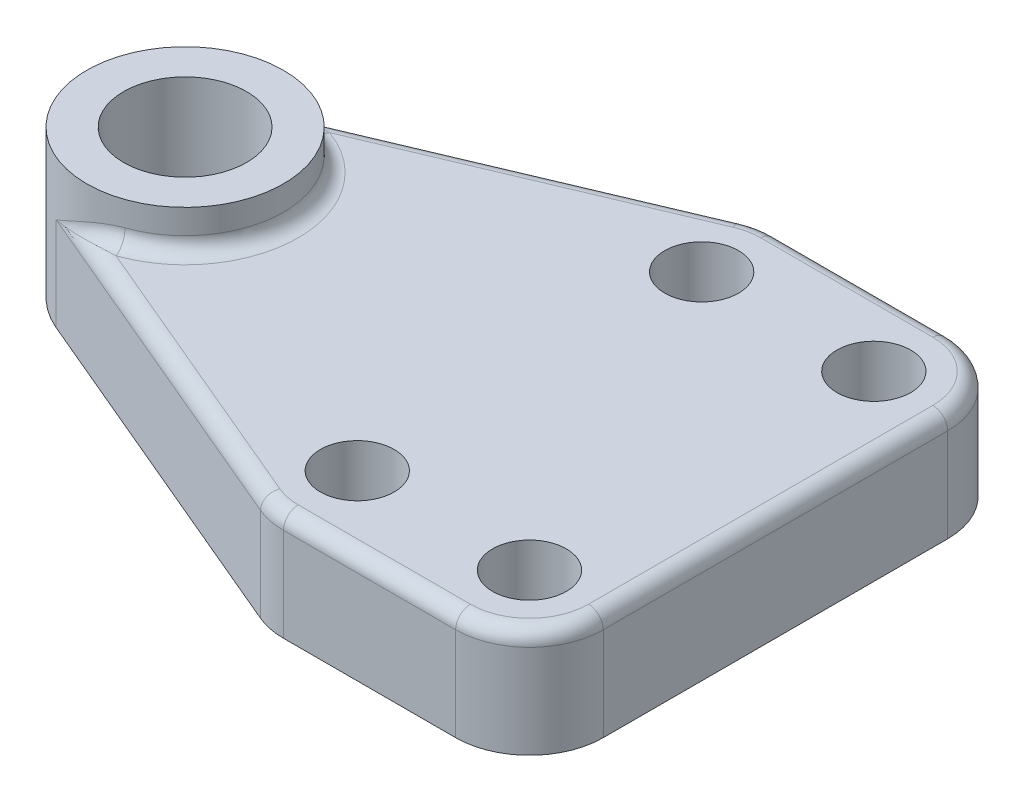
ISO-10303-21;
HEADER;
FILE_DESCRIPTION(('STEP AP214'),'2;1');
FILE_NAME('part.step','',(''),(''),'','','');
FILE_SCHEMA(('AUTOMOTIVE_DESIGN { 1 0 10303 214 1 1 1 1 }'));
ENDSEC;
DATA;
#1=APPLICATION_CONTEXT('core data for automotive mechanical design processes');
#2=APPLICATION_PROTOCOL_DEFINITION('international standard','automotive_design',2000,#1);
#3=PRODUCT_CONTEXT('',#1,'mechanical');
#4=PRODUCT('Part','Part','',(#3));
#5=PRODUCT_RELATED_PRODUCT_CATEGORY('part','',(#4));
#6=PRODUCT_DEFINITION_FORMATION('','',#4);
#7=PRODUCT_DEFINITION_CONTEXT('part definition',#1,'design');
#8=PRODUCT_DEFINITION('design','',#6,#7);
#9=PRODUCT_DEFINITION_SHAPE('','',#8);
#10=(LENGTH_UNIT() NAMED_UNIT(*) SI_UNIT(.MILLI.,.METRE.));
#11=(NAMED_UNIT(*) PLANE_ANGLE_UNIT() SI_UNIT($,.RADIAN.));
#12=(NAMED_UNIT(*) SI_UNIT($,.STERADIAN.) SOLID_ANGLE_UNIT());
#13=UNCERTAINTY_MEASURE_WITH_UNIT(LENGTH_MEASURE(1.E-05),#10,'distance_accuracy_value','');
#14=(GEOMETRIC_REPRESENTATION_CONTEXT(3) GLOBAL_UNCERTAINTY_ASSIGNED_CONTEXT((#13)) GLOBAL_UNIT_ASSIGNED_CONTEXT((#10,
#11,#12)) REPRESENTATION_CONTEXT('',''));
#15=CARTESIAN_POINT('',(0.,0.,0.));
#16=DIRECTION('',(0.,0.,1.));
#17=DIRECTION('',(1.,0.,0.));
#18=AXIS2_PLACEMENT_3D('',#15,#16,#17);
#19=CARTESIAN_POINT('',(70.,22.,35.));
#20=DIRECTION('',(0.,-1.,0.));
#21=DIRECTION('',(0.,0.,-1.));
#22=AXIS2_PLACEMENT_3D('',#19,#20,#21);
#23=CYLINDRICAL_SURFACE('',#22,15.);
#24=DIRECTION('',(0.,-1.,0.));
#25=VECTOR('',#24,1.);
#26=CARTESIAN_POINT('',(70.,22.,50.));
#27=LINE('',#26,#25);
#28=CARTESIAN_POINT('',(70.,19.,50.));
#29=VERTEX_POINT('',#28);
#30=CARTESIAN_POINT('',(70.,0.,50.));
#31=VERTEX_POINT('',#30);
#32=EDGE_CURVE('E281',#29,#31,#27,.T.);
#33=ORIENTED_EDGE('',*,*,#32,.F.);
#34=CARTESIAN_POINT('',(70.,19.,35.));
#35=DIRECTION('',(0.,-1.,0.));
#36=DIRECTION('',(0.,0.,-1.));
#37=AXIS2_PLACEMENT_3D('',#34,#35,#36);
#38=CIRCLE('',#37,15.);
#39=CARTESIAN_POINT('',(64.1626431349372,19.,48.8175708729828));
#40=VERTEX_POINT('',#39);
#41=EDGE_CURVE('E553',#29,#40,#38,.T.);
#42=ORIENTED_EDGE('',*,*,#41,.T.);
#43=DIRECTION('',(0.,-1.,0.));
#44=VECTOR('',#43,1.);
#45=CARTESIAN_POINT('',(64.1626431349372,22.,48.8175708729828));
#46=LINE('',#45,#44);
#47=CARTESIAN_POINT('',(64.1626431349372,0.,48.8175708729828));
#48=VERTEX_POINT('',#47);
#49=EDGE_CURVE('E307',#40,#48,#46,.T.);
#50=ORIENTED_EDGE('',*,*,#49,.T.);
#51=CARTESIAN_POINT('',(70.,0.,35.));
#52=DIRECTION('',(0.,1.,0.));
#53=DIRECTION('',(0.,0.,-1.));
#54=AXIS2_PLACEMENT_3D('',#51,#52,#53);
#55=CIRCLE('',#54,15.);
#56=EDGE_CURVE('E300',#48,#31,#55,.T.);
#57=ORIENTED_EDGE('',*,*,#56,.T.);
#58=EDGE_LOOP('',(#33,#42,#50,#57));
#59=FACE_BOUND('',#58,.T.);
#60=ADVANCED_FACE('F47',(#59),#23,.T.);
#61=CARTESIAN_POINT('',(105.,22.,50.));
#62=DIRECTION('',(0.,0.,-1.));
#63=DIRECTION('',(-1.,0.,0.));
#64=AXIS2_PLACEMENT_3D('',#61,#62,#63);
#65=PLANE('',#64);
#66=DIRECTION('',(0.,-1.,0.));
#67=VECTOR('',#66,1.);
#68=CARTESIAN_POINT('',(105.,22.,50.));
#69=LINE('',#68,#67);
#70=CARTESIAN_POINT('',(105.,19.,50.));
#71=VERTEX_POINT('',#70);
#72=CARTESIAN_POINT('',(105.,0.,50.));
#73=VERTEX_POINT('',#72);
#74=EDGE_CURVE('E294',#71,#73,#69,.T.);
#75=ORIENTED_EDGE('',*,*,#74,.F.);
#76=DIRECTION('',(1.,0.,0.));
#77=VECTOR('',#76,1.);
#78=CARTESIAN_POINT('',(105.,19.,50.));
#79=LINE('',#78,#77);
#80=EDGE_CURVE('E288',#71,#29,#79,.F.);
#81=ORIENTED_EDGE('',*,*,#80,.T.);
#82=ORIENTED_EDGE('',*,*,#32,.T.);
#83=DIRECTION('',(1.,0.,0.));
#84=VECTOR('',#83,1.);
#85=CARTESIAN_POINT('',(105.,0.,50.));
#86=LINE('',#85,#84);
#87=EDGE_CURVE('E285',#31,#73,#86,.T.);
#88=ORIENTED_EDGE('',*,*,#87,.T.);
#89=EDGE_LOOP('',(#75,#81,#82,#88));
#90=FACE_BOUND('',#89,.T.);
#91=ADVANCED_FACE('F284',(#90),#65,.F.);
#92=CARTESIAN_POINT('',(105.,22.,35.));
#93=DIRECTION('',(0.,-1.,0.));
#94=DIRECTION('',(0.,0.,-1.));
#95=AXIS2_PLACEMENT_3D('',#92,#93,#94);
#96=CYLINDRICAL_SURFACE('',#95,15.);
#97=DIRECTION('',(0.,-1.,0.));
#98=VECTOR('',#97,1.);
#99=CARTESIAN_POINT('',(120.,22.,35.));
#100=LINE('',#99,#98);
#101=CARTESIAN_POINT('',(120.,19.,35.));
#102=VERTEX_POINT('',#101);
#103=CARTESIAN_POINT('',(120.,0.,35.));
#104=VERTEX_POINT('',#103);
#105=EDGE_CURVE('E367',#102,#104,#100,.T.);
#106=ORIENTED_EDGE('',*,*,#105,.F.);
#107=CARTESIAN_POINT('',(105.,19.,35.));
#108=DIRECTION('',(0.,-1.,0.));
#109=DIRECTION('',(0.,0.,-1.));
#110=AXIS2_PLACEMENT_3D('',#107,#108,#109);
#111=CIRCLE('',#110,15.);
#112=EDGE_CURVE('E548',#102,#71,#111,.T.);
#113=ORIENTED_EDGE('',*,*,#112,.T.);
#114=ORIENTED_EDGE('',*,*,#74,.T.);
#115=CARTESIAN_POINT('',(105.,0.,35.));
#116=DIRECTION('',(0.,1.,0.));
#117=DIRECTION('',(0.,0.,1.));
#118=AXIS2_PLACEMENT_3D('',#115,#116,#117);
#119=CIRCLE('',#118,15.);
#120=EDGE_CURVE('E303',#73,#104,#119,.T.);
#121=ORIENTED_EDGE('',*,*,#120,.T.);
#122=EDGE_LOOP('',(#106,#113,#114,#121));
#123=FACE_BOUND('',#122,.T.);
#124=ADVANCED_FACE('F654',(#123),#96,.T.);
#125=CARTESIAN_POINT('',(120.,22.,-35.));
#126=DIRECTION('',(-1.,0.,0.));
#127=DIRECTION('',(0.,0.,1.));
#128=AXIS2_PLACEMENT_3D('',#125,#126,#127);
#129=PLANE('',#128);
#130=DIRECTION('',(0.,-1.,0.));
#131=VECTOR('',#130,1.);
#132=CARTESIAN_POINT('',(120.,22.,-35.));
#133=LINE('',#132,#131);
#134=CARTESIAN_POINT('',(120.,19.,-35.));
#135=VERTEX_POINT('',#134);
#136=CARTESIAN_POINT('',(120.,0.,-35.));
#137=VERTEX_POINT('',#136);
#138=EDGE_CURVE('E364',#135,#137,#133,.T.);
#139=ORIENTED_EDGE('',*,*,#138,.F.);
#140=DIRECTION('',(0.,0.,-1.));
#141=VECTOR('',#140,1.);
#142=CARTESIAN_POINT('',(120.,19.,-35.));
#143=LINE('',#142,#141);
#144=EDGE_CURVE('E545',#135,#102,#143,.F.);
#145=ORIENTED_EDGE('',*,*,#144,.T.);
#146=ORIENTED_EDGE('',*,*,#105,.T.);
#147=DIRECTION('',(0.,0.,-1.));
#148=VECTOR('',#147,1.);
#149=CARTESIAN_POINT('',(120.,0.,-35.));
#150=LINE('',#149,#148);
#151=EDGE_CURVE('E320',#104,#137,#150,.T.);
#152=ORIENTED_EDGE('',*,*,#151,.T.);
#153=EDGE_LOOP('',(#139,#145,#146,#152));
#154=FACE_BOUND('',#153,.T.);
#155=ADVANCED_FACE('F1043',(#154),#129,.F.);
#156=CARTESIAN_POINT('',(105.,22.,-35.));
#157=DIRECTION('',(0.,-1.,0.));
#158=DIRECTION('',(0.,0.,-1.));
#159=AXIS2_PLACEMENT_3D('',#156,#157,#158);
#160=CYLINDRICAL_SURFACE('',#159,15.);
#161=DIRECTION('',(0.,-1.,0.));
#162=VECTOR('',#161,1.);
#163=CARTESIAN_POINT('',(105.,22.,-50.));
#164=LINE('',#163,#162);
#165=CARTESIAN_POINT('',(105.,19.,-50.));
#166=VERTEX_POINT('',#165);
#167=CARTESIAN_POINT('',(105.,0.,-50.));
#168=VERTEX_POINT('',#167);
#169=EDGE_CURVE('E361',#166,#168,#164,.T.);
#170=ORIENTED_EDGE('',*,*,#169,.F.);
#171=CARTESIAN_POINT('',(105.,19.,-35.));
#172=DIRECTION('',(0.,-1.,0.));
#173=DIRECTION('',(0.,0.,-1.));
#174=AXIS2_PLACEMENT_3D('',#171,#172,#173);
#175=CIRCLE('',#174,15.);
#176=EDGE_CURVE('E542',#166,#135,#175,.T.);
#177=ORIENTED_EDGE('',*,*,#176,.T.);
#178=ORIENTED_EDGE('',*,*,#138,.T.);
#179=CARTESIAN_POINT('',(105.,0.,-35.));
#180=DIRECTION('',(0.,1.,0.));
#181=DIRECTION('',(0.,0.,1.));
#182=AXIS2_PLACEMENT_3D('',#179,#180,#181);
#183=CIRCLE('',#182,15.);
#184=EDGE_CURVE('E324',#137,#168,#183,.T.);
#185=ORIENTED_EDGE('',*,*,#184,.T.);
#186=EDGE_LOOP('',(#170,#177,#178,#185));
#187=FACE_BOUND('',#186,.T.);
#188=ADVANCED_FACE('F1040',(#187),#160,.T.);
#189=CARTESIAN_POINT('',(105.,22.,-50.));
#190=DIRECTION('',(0.,0.,1.));
#191=DIRECTION('',(1.,0.,0.));
#192=AXIS2_PLACEMENT_3D('',#189,#190,#191);
#193=PLANE('',#192);
#194=DIRECTION('',(0.,-1.,0.));
#195=VECTOR('',#194,1.);
#196=CARTESIAN_POINT('',(70.,22.,-50.));
#197=LINE('',#196,#195);
#198=CARTESIAN_POINT('',(70.,19.,-50.));
#199=VERTEX_POINT('',#198);
#200=CARTESIAN_POINT('',(70.,0.,-50.));
#201=VERTEX_POINT('',#200);
#202=EDGE_CURVE('E358',#199,#201,#197,.T.);
#203=ORIENTED_EDGE('',*,*,#202,.F.);
#204=DIRECTION('',(-1.,0.,0.));
#205=VECTOR('',#204,1.);
#206=CARTESIAN_POINT('',(105.,19.,-50.));
#207=LINE('',#206,#205);
#208=EDGE_CURVE('E539',#199,#166,#207,.F.);
#209=ORIENTED_EDGE('',*,*,#208,.T.);
#210=ORIENTED_EDGE('',*,*,#169,.T.);
#211=DIRECTION('',(-1.,0.,0.));
#212=VECTOR('',#211,1.);
#213=CARTESIAN_POINT('',(105.,0.,-50.));
#214=LINE('',#213,#212);
#215=EDGE_CURVE('E328',#168,#201,#214,.T.);
#216=ORIENTED_EDGE('',*,*,#215,.T.);
#217=EDGE_LOOP('',(#203,#209,#210,#216));
#218=FACE_BOUND('',#217,.T.);
#219=ADVANCED_FACE('F1070',(#218),#193,.F.);
#220=CARTESIAN_POINT('',(70.,22.,-35.));
#221=DIRECTION('',(0.,-1.,0.));
#222=DIRECTION('',(0.,0.,-1.));
#223=AXIS2_PLACEMENT_3D('',#220,#221,#222);
#224=CYLINDRICAL_SURFACE('',#223,15.);
#225=DIRECTION('',(0.,-1.,0.));
#226=VECTOR('',#225,1.);
#227=CARTESIAN_POINT('',(64.1626431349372,22.,-48.8175708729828));
#228=LINE('',#227,#226);
#229=CARTESIAN_POINT('',(64.1626431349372,19.,-48.8175708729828));
#230=VERTEX_POINT('',#229);
#231=CARTESIAN_POINT('',(64.1626431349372,0.,-48.8175708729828));
#232=VERTEX_POINT('',#231);
#233=EDGE_CURVE('E355',#230,#232,#228,.T.);
#234=ORIENTED_EDGE('',*,*,#233,.F.);
#235=CARTESIAN_POINT('',(70.,19.,-35.));
#236=DIRECTION('',(0.,-1.,0.));
#237=DIRECTION('',(0.,0.,-1.));
#238=AXIS2_PLACEMENT_3D('',#235,#236,#237);
#239=CIRCLE('',#238,15.);
#240=EDGE_CURVE('E536',#230,#199,#239,.T.);
#241=ORIENTED_EDGE('',*,*,#240,.T.);
#242=ORIENTED_EDGE('',*,*,#202,.T.);
#243=CARTESIAN_POINT('',(70.,0.,-35.));
#244=DIRECTION('',(0.,1.,0.));
#245=DIRECTION('',(0.,0.,1.));
#246=AXIS2_PLACEMENT_3D('',#243,#244,#245);
#247=CIRCLE('',#246,15.);
#248=EDGE_CURVE('E332',#201,#232,#247,.T.);
#249=ORIENTED_EDGE('',*,*,#248,.T.);
#250=EDGE_LOOP('',(#234,#241,#242,#249));
#251=FACE_BOUND('',#250,.T.);
#252=ADVANCED_FACE('F1066',(#251),#224,.T.);
#253=CARTESIAN_POINT('',(64.1626431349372,22.,-48.8175708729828));
#254=DIRECTION('',(0.389157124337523,0.,0.921171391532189));
#255=DIRECTION('',(0.921171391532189,0.,-0.389157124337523));
#256=AXIS2_PLACEMENT_3D('',#253,#254,#255);
#257=PLANE('',#256);
#258=DIRECTION('',(0.,-1.,0.));
#259=VECTOR('',#258,1.);
#260=CARTESIAN_POINT('',(-7.78314248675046,22.,-18.4234278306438));
#261=LINE('',#260,#259);
#262=CARTESIAN_POINT('',(-7.78314248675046,19.,-18.4234278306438));
#263=VERTEX_POINT('',#262);
#264=CARTESIAN_POINT('',(-7.78314248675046,0.,-18.4234278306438));
#265=VERTEX_POINT('',#264);
#266=EDGE_CURVE('E352',#263,#265,#261,.T.);
#267=ORIENTED_EDGE('',*,*,#266,.F.);
#268=DIRECTION('',(-0.921171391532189,0.,0.389157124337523));
#269=VECTOR('',#268,1.);
#270=CARTESIAN_POINT('',(64.1626431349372,19.,-48.8175708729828));
#271=LINE('',#270,#269);
#272=EDGE_CURVE('E532',#263,#230,#271,.F.);
#273=ORIENTED_EDGE('',*,*,#272,.T.);
#274=ORIENTED_EDGE('',*,*,#233,.T.);
#275=DIRECTION('',(-0.921171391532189,0.,0.389157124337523));
#276=VECTOR('',#275,1.);
#277=CARTESIAN_POINT('',(64.1626431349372,0.,-48.8175708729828));
#278=LINE('',#277,#276);
#279=EDGE_CURVE('E336',#232,#265,#278,.T.);
#280=ORIENTED_EDGE('',*,*,#279,.T.);
#281=EDGE_LOOP('',(#267,#273,#274,#280));
#282=FACE_BOUND('',#281,.T.);
#283=ADVANCED_FACE('F583',(#282),#257,.F.);
#284=CARTESIAN_POINT('',(0.,22.,0.));
#285=DIRECTION('',(0.,-1.,0.));
#286=DIRECTION('',(0.,0.,-1.));
#287=AXIS2_PLACEMENT_3D('',#284,#285,#286);
#288=CYLINDRICAL_SURFACE('',#287,20.);
#289=CARTESIAN_POINT('',(0.,0.,0.));
#290=DIRECTION('',(0.,1.,0.));
#291=DIRECTION('',(0.,0.,1.));
#292=AXIS2_PLACEMENT_3D('',#289,#290,#291);
#293=CIRCLE('',#292,20.);
#294=CARTESIAN_POINT('',(-7.78314248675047,0.,18.4234278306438));
#295=VERTEX_POINT('',#294);
#296=EDGE_CURVE('E340',#265,#295,#293,.T.);
#297=ORIENTED_EDGE('',*,*,#296,.T.);
#298=DIRECTION('',(0.,-1.,0.));
#299=VECTOR('',#298,1.);
#300=CARTESIAN_POINT('',(-7.78314248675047,22.,18.4234278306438));
#301=LINE('',#300,#299);
#302=CARTESIAN_POINT('',(-7.78314248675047,19.,18.4234278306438));
#303=VERTEX_POINT('',#302);
#304=EDGE_CURVE('E349',#303,#295,#301,.T.);
#305=ORIENTED_EDGE('',*,*,#304,.F.);
#306=CARTESIAN_POINT('',(9.99717735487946,21.7977129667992,21.5025271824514));
#307=CARTESIAN_POINT('',(8.09791665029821,20.9486676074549,18.3190477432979));
#308=CARTESIAN_POINT('',(9.05966862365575,24.5954259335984,17.8303786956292));
#309=CARTESIAN_POINT('',(9.81525832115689,21.8339372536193,21.5272918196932));
#310=CARTESIAN_POINT('',(8.01726023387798,21.0544504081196,18.3472751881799));
#311=CARTESIAN_POINT('',(8.86980159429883,24.6678745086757,17.9268945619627));
#312=CARTESIAN_POINT('',(9.62878091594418,21.864730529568,21.5499834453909));
#313=CARTESIAN_POINT('',(7.92484199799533,21.1587536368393,18.3819365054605));
#314=CARTESIAN_POINT('',(8.67601667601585,24.7294610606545,18.0214991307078));
#315=CARTESIAN_POINT('',(9.24847370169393,21.9162971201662,21.5908131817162));
#316=CARTESIAN_POINT('',(7.71929005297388,21.3581824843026,18.4607267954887));
#317=CARTESIAN_POINT('',(8.28250463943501,24.8325942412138,18.2056806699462));
#318=CARTESIAN_POINT('',(9.0546563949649,21.9370867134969,21.6089586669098));
#319=CARTESIAN_POINT('',(7.60673118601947,21.453442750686,18.5045993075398));
#320=CARTESIAN_POINT('',(8.08278774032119,24.8741734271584,18.2952655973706));
#321=CARTESIAN_POINT('',(8.66267288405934,21.9694483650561,21.6402249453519));
#322=CARTESIAN_POINT('',(7.3636065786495,21.6312349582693,18.5985274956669));
#323=CARTESIAN_POINT('',(7.68056589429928,24.9388967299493,18.4677142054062));
#324=CARTESIAN_POINT('',(8.4645643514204,21.9811048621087,21.6533911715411));
#325=CARTESIAN_POINT('',(7.23369800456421,21.7140814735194,18.6483530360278));
#326=CARTESIAN_POINT('',(7.47810452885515,24.9622097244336,18.5506329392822));
#327=CARTESIAN_POINT('',(8.06332353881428,21.9963825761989,21.6747811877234));
#328=CARTESIAN_POINT('',(6.95738287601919,21.8665545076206,18.7516944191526));
#329=CARTESIAN_POINT('',(7.06969241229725,24.9927651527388,18.7100917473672));
#330=CARTESIAN_POINT('',(7.86018850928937,21.9999992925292,21.6830022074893));
#331=CARTESIAN_POINT('',(6.81132443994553,21.9364507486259,18.8051313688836));
#332=CARTESIAN_POINT('',(6.86373977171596,24.9999985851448,18.7866282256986));
#333=CARTESIAN_POINT('',(7.3517521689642,22.0000010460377,21.6971490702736));
#334=CARTESIAN_POINT('',(6.43360837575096,22.0915575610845,18.9384354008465));
#335=CARTESIAN_POINT('',(6.35025544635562,25.0000020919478,18.9678593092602));
#336=CARTESIAN_POINT('',(7.04408005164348,21.9920969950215,21.7000937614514));
#337=CARTESIAN_POINT('',(6.19235294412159,22.1700368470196,19.019656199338));
#338=CARTESIAN_POINT('',(6.04127927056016,24.9841939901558,19.0685009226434));
#339=CARTESIAN_POINT('',(6.42262016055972,21.9628720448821,21.6950678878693));
#340=CARTESIAN_POINT('',(5.68594563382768,22.2961986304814,19.1783402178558));
#341=CARTESIAN_POINT('',(5.42060611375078,24.9257440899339,19.2541449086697));
#342=CARTESIAN_POINT('',(6.10883059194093,21.9415471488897,21.6870940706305));
#343=CARTESIAN_POINT('',(5.42123068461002,22.3447982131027,19.2559804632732));
#344=CARTESIAN_POINT('',(5.1089083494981,24.8830942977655,19.3391426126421));
#345=CARTESIAN_POINT('',(5.47540564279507,21.887404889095,21.6604549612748));
#346=CARTESIAN_POINT('',(4.87284627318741,22.4134495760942,19.4033362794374));
#347=CARTESIAN_POINT('',(4.48299244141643,24.774809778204,19.4937743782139));
#348=CARTESIAN_POINT('',(5.15574815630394,21.8545274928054,21.6417334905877));
#349=CARTESIAN_POINT('',(4.58916880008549,22.4341552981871,19.4733288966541));
#350=CARTESIAN_POINT('',(4.16876967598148,24.7090549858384,19.5633250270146));
#351=CARTESIAN_POINT('',(4.51361229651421,21.7790785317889,21.5939543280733));
#352=CARTESIAN_POINT('',(4.0092141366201,22.4494888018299,19.60191091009));
#353=CARTESIAN_POINT('',(3.54072174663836,24.5581570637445,19.6866907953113));
#354=CARTESIAN_POINT('',(4.19113301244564,21.7365037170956,21.5648931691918));
#355=CARTESIAN_POINT('',(3.7128087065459,22.4447440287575,19.6608641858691));
#356=CARTESIAN_POINT('',(3.22689675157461,24.4730074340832,19.7405006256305));
#357=CARTESIAN_POINT('',(3.37177254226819,21.6182492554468,21.4786921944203));
#358=CARTESIAN_POINT('',(2.95529026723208,22.4038405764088,19.7925495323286));
#359=CARTESIAN_POINT('',(2.43337871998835,24.2364985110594,19.8573504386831));
#360=CARTESIAN_POINT('',(2.87373730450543,21.5370335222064,21.4148456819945));
#361=CARTESIAN_POINT('',(2.48304088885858,22.3532670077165,19.858106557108));
#362=CARTESIAN_POINT('',(1.95462080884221,24.074067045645,19.909969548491));
#363=CARTESIAN_POINT('',(1.87662358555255,21.3597721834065,21.2653883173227));
#364=CARTESIAN_POINT('',(1.52980994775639,22.2085531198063,19.95380643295));
#365=CARTESIAN_POINT('',(1.00284485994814,23.7195443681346,19.9805480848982));
#366=CARTESIAN_POINT('',(1.37754468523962,21.2637185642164,21.1797656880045));
#367=CARTESIAN_POINT('',(1.04721428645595,22.1153247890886,19.9851053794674));
#368=CARTESIAN_POINT('',(0.529830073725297,23.5274371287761,19.9984887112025));
#369=CARTESIAN_POINT('',(0.380509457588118,21.0602258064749,20.9881824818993));
#370=CARTESIAN_POINT('',(0.0807878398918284,21.8951129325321,20.0113863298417));
#371=CARTESIAN_POINT('',(-0.40873572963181,23.1204516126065,20.001327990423));
#372=CARTESIAN_POINT('',(-0.117446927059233,20.9527872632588,20.8822229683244));
#373=CARTESIAN_POINT('',(-0.40488191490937,21.7684876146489,20.0072623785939));
#374=CARTESIAN_POINT('',(-0.874287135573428,22.9055745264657,19.9862283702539));
#375=CARTESIAN_POINT('',(-1.11063243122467,20.7292909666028,20.6512147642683));
#376=CARTESIAN_POINT('',(-1.37233919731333,21.4897170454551,19.9630792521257));
#377=CARTESIAN_POINT('',(-1.79670874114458,22.4585819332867,19.9244942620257));
#378=CARTESIAN_POINT('',(-1.605862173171,20.613235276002,20.5261706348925));
#379=CARTESIAN_POINT('',(-1.85604405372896,21.3375247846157,19.9236177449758));
#380=CARTESIAN_POINT('',(-2.25358098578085,22.2264705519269,19.8778672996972));
#381=CARTESIAN_POINT('',(-2.93187810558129,20.2927510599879,20.1657888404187));
#382=CARTESIAN_POINT('',(-3.13973912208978,20.905478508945,19.7709856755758));
#383=CARTESIAN_POINT('',(-3.46892212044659,21.5855021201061,19.7119234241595));
#384=CARTESIAN_POINT('',(-3.75945523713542,20.0823857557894,19.9136970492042));
#385=CARTESIAN_POINT('',(-3.94691589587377,20.604750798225,19.625549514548));
#386=CARTESIAN_POINT('',(-4.21895529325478,21.1647715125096,19.5646749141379));
#387=CARTESIAN_POINT('',(-5.39882935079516,19.6525203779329,19.3620442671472));
#388=CARTESIAN_POINT('',(-5.52403416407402,19.978132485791,19.2395355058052));
#389=CARTESIAN_POINT('',(-5.6884244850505,20.3050407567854,19.1889549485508));
#390=CARTESIAN_POINT('',(-6.21064965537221,19.4330356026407,19.0625605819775));
#391=CARTESIAN_POINT('',(-6.30265198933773,19.6494014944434,18.9984174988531));
#392=CARTESIAN_POINT('',(-6.40790795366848,19.8660712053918,18.9606150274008));
#393=CARTESIAN_POINT('',(-7.26244285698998,19.1440615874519,18.6404974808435));
#394=CARTESIAN_POINT('',(-7.29518079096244,19.2161402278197,18.6237726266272));
#395=CARTESIAN_POINT('',(-7.32945477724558,19.2881231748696,18.6100408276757));
#396=CARTESIAN_POINT('',(-7.51080525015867,19.0754822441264,18.53829931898));
#397=CARTESIAN_POINT('',(-7.5284941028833,19.1132249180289,18.5306470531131));
#398=CARTESIAN_POINT('',(-7.54627144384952,19.1509644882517,18.5231833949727));
#399=CARTESIAN_POINT('',(-7.76655291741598,19.0045988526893,18.4304333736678));
#400=CARTESIAN_POINT('',(-7.76763374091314,19.0068982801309,18.4299738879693));
#401=CARTESIAN_POINT('',(-7.76871587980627,19.0091977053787,18.4295174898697));
#402=CARTESIAN_POINT('',(-7.77484821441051,19.0022994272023,18.4269318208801));
#403=CARTESIAN_POINT('',(-7.77538914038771,19.0034491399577,18.4267032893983));
#404=CARTESIAN_POINT('',(-7.77593007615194,19.0045988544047,18.4264747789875));
#405=CARTESIAN_POINT('',(-7.78314248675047,19.,18.4234278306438));
#406=CARTESIAN_POINT('',(-7.78314248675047,19.,18.4234278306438));
#407=CARTESIAN_POINT('',(-7.78314248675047,19.,18.4234278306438));
#408=(BOUNDED_SURFACE() B_SPLINE_SURFACE(3,2,((#306,#307,#308),(#309,#310,#311),(#312,#313,
#314),(#315,#316,#317),(#318,#319,#320),(#321,#322,#323),(#324,#325,#326),(#327,#328,#329),
(#330,#331,#332),(#333,#334,#335),(#336,#337,#338),(#339,#340,#341),(#342,#343,#344),(#345,#346,
#347),(#348,#349,#350),(#351,#352,#353),(#354,#355,#356),(#357,#358,#359),(#360,#361,#362),
(#363,#364,#365),(#366,#367,#368),(#369,#370,#371),(#372,#373,#374),(#375,#376,#377),(#378,#379,
#380),(#381,#382,#383),(#384,#385,#386),(#387,#388,#389),(#390,#391,#392),(#393,#394,#395),
(#396,#397,#398),(#399,#400,#401),(#402,#403,#404),(#405,#406,#407)),.UNSPECIFIED.,.F.,.F.,
.F.) B_SPLINE_SURFACE_WITH_KNOTS((4,2,2,2,2,2,2,2,2,2,2,2,2,2,2,2,4),(3,3),(0.,
0.765740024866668,1.53022973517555,2.28756520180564,3.04532452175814,4.1657169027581,
5.28644310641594,6.41308144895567,7.54009792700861,9.2690715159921,10.9989821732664,
12.7288024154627,14.4582098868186,17.3757366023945,20.28855239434,21.1932391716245,
21.2235706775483),(0.,1.),
.UNSPECIFIED.) GEOMETRIC_REPRESENTATION_ITEM() RATIONAL_B_SPLINE_SURFACE(((1.,0.619345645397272,
1.),(1.,0.626281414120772,1.),(1.,0.633400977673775,1.),(1.,0.647875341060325,1.),(1.,
0.655229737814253,1.),(1.,0.669995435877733,1.),(1.,0.677405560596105,1.),(1.,0.692255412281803,
1.),(1.,0.699695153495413,1.),(1.,0.718065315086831,1.),(1.,0.728962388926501,1.),(1.,
0.750420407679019,1.),(1.,0.76098125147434,1.),(1.,0.781671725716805,1.),(1.,0.791798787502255,
1.),(1.,0.811460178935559,1.),(1.,0.820994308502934,1.),(1.,0.844312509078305,1.),(1.,
0.857646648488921,1.),(1.,0.882598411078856,1.),(1.,0.894215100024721,1.),(1.,0.9156580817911,
1.),(1.,0.925484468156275,1.),(1.,0.943317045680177,1.),(1.,0.951323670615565,1.),(1.,
0.97039180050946,1.),(1.,0.979773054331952,1.),(1.,0.993354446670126,1.),(1.,0.997562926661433,
1.),(1.,0.999718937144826,1.),(1.,0.99998259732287,1.),(1.,0.999999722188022,1.),(1.,
0.999999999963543,1.),(1.,1.,1.))) REPRESENTATION_ITEM('') SURFACE());
#409=CARTESIAN_POINT('',(9.05966862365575,24.5954259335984,17.8303786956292));
#410=CARTESIAN_POINT('',(8.86980159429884,24.6678745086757,17.9268945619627));
#411=CARTESIAN_POINT('',(8.67601667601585,24.7294610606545,18.0214991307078));
#412=CARTESIAN_POINT('',(8.28250463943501,24.8325942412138,18.2056806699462));
#413=CARTESIAN_POINT('',(8.08278774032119,24.8741734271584,18.2952655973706));
#414=CARTESIAN_POINT('',(7.68056589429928,24.9388967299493,18.4677142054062));
#415=CARTESIAN_POINT('',(7.47810452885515,24.9622097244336,18.5506329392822));
#416=CARTESIAN_POINT('',(7.06969241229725,24.9927651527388,18.7100917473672));
#417=CARTESIAN_POINT('',(6.86373977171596,24.9999985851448,18.7866282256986));
#418=CARTESIAN_POINT('',(6.35025544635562,25.0000020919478,18.9678593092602));
#419=CARTESIAN_POINT('',(6.04127927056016,24.9841939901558,19.0685009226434));
#420=CARTESIAN_POINT('',(5.42060611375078,24.9257440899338,19.2541449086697));
#421=CARTESIAN_POINT('',(5.1089083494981,24.8830942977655,19.3391426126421));
#422=CARTESIAN_POINT('',(4.48299244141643,24.774809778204,19.4937743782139));
#423=CARTESIAN_POINT('',(4.16876967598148,24.7090549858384,19.5633250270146));
#424=CARTESIAN_POINT('',(3.54072174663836,24.5581570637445,19.6866907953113));
#425=CARTESIAN_POINT('',(3.22689675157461,24.4730074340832,19.7405006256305));
#426=CARTESIAN_POINT('',(2.43337871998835,24.2364985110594,19.8573504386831));
#427=CARTESIAN_POINT('',(1.95462080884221,24.074067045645,19.909969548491));
#428=CARTESIAN_POINT('',(1.00284485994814,23.7195443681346,19.9805480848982));
#429=CARTESIAN_POINT('',(0.529830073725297,23.5274371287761,19.9984887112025));
#430=CARTESIAN_POINT('',(-0.408735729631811,23.1204516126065,20.001327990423));
#431=CARTESIAN_POINT('',(-0.874287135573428,22.9055745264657,19.9862283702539));
#432=CARTESIAN_POINT('',(-1.79670874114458,22.4585819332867,19.9244942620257));
#433=CARTESIAN_POINT('',(-2.25358098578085,22.2264705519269,19.8778672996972));
#434=CARTESIAN_POINT('',(-3.46892212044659,21.5855021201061,19.7119234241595));
#435=CARTESIAN_POINT('',(-4.21895529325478,21.1647715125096,19.5646749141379));
#436=CARTESIAN_POINT('',(-5.6884244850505,20.3050407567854,19.1889549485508));
#437=CARTESIAN_POINT('',(-6.40790795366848,19.8660712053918,18.9606150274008));
#438=CARTESIAN_POINT('',(-7.32945477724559,19.2881231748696,18.6100408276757));
#439=CARTESIAN_POINT('',(-7.54627144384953,19.1509644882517,18.5231833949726));
#440=CARTESIAN_POINT('',(-7.76871587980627,19.0091977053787,18.4295174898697));
#441=CARTESIAN_POINT('',(-7.77593007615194,19.0045988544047,18.4264747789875));
#442=CARTESIAN_POINT('',(-7.78314248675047,19.,18.4234278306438));
#443=B_SPLINE_CURVE_WITH_KNOTS('',3,(#409,#410,#411,#412,#413,#414,#415,#416,#417,#418,#419,
#420,#421,#422,#423,#424,#425,#426,#427,#428,#429,#430,#431,#432,#433,#434,#435,#436,#437,#438,
#439,#440,#441,#442),.UNSPECIFIED.,.F.,.F.,(4,2,2,2,2,2,2,2,2,2,2,2,2,2,2,2,4),(0.,
0.765740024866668,1.53022973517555,2.28756520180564,3.04532452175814,4.1657169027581,
5.28644310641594,6.41308144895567,7.54009792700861,9.2690715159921,10.9989821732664,
12.7288024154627,14.4582098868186,17.3757366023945,20.28855239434,21.1932391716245,
21.2235706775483),.UNSPECIFIED.);
#444=CARTESIAN_POINT('',(6.65656932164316,25.,18.8597477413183));
#445=VERTEX_POINT('',#444);
#446=EDGE_CURVE('E57',#303,#445,#443,.F.);
#447=ORIENTED_EDGE('',*,*,#446,.T.);
#448=CARTESIAN_POINT('',(0.,25.,0.));
#449=DIRECTION('',(0.,-1.,0.));
#450=DIRECTION('',(0.,0.,-1.));
#451=AXIS2_PLACEMENT_3D('',#448,#449,#450);
#452=CIRCLE('',#451,20.);
#453=CARTESIAN_POINT('',(6.65656932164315,25.,-18.8597477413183));
#454=VERTEX_POINT('',#453);
#455=EDGE_CURVE('E64',#445,#454,#452,.F.);
#456=ORIENTED_EDGE('',*,*,#455,.T.);
#457=CARTESIAN_POINT('',(9.05966862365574,24.5954259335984,-17.8303786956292));
#458=CARTESIAN_POINT('',(8.09791665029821,20.948667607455,-18.319047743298));
#459=CARTESIAN_POINT('',(9.99717735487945,21.7977129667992,-21.5025271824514));
#460=CARTESIAN_POINT('',(8.86980159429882,24.6678745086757,-17.9268945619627));
#461=CARTESIAN_POINT('',(8.01726023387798,21.0544504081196,-18.3472751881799));
#462=CARTESIAN_POINT('',(9.81525832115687,21.8339372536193,-21.5272918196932));
#463=CARTESIAN_POINT('',(8.67601667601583,24.7294610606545,-18.0214991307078));
#464=CARTESIAN_POINT('',(7.92484199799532,21.1587536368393,-18.3819365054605));
#465=CARTESIAN_POINT('',(9.62878091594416,21.864730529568,-21.5499834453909));
#466=CARTESIAN_POINT('',(8.28250463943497,24.8325942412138,-18.2056806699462));
#467=CARTESIAN_POINT('',(7.71929005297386,21.3581824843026,-18.4607267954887));
#468=CARTESIAN_POINT('',(9.24847370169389,21.9162971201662,-21.5908131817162));
#469=CARTESIAN_POINT('',(8.08278774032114,24.8741734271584,-18.2952655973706));
#470=CARTESIAN_POINT('',(7.60673118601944,21.4534427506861,-18.5045993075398));
#471=CARTESIAN_POINT('',(9.05465639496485,21.937086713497,-21.6089586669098));
#472=CARTESIAN_POINT('',(7.68056589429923,24.9388967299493,-18.4677142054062));
#473=CARTESIAN_POINT('',(7.36360657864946,21.6312349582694,-18.598527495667));
#474=CARTESIAN_POINT('',(8.66267288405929,21.9694483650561,-21.6402249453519));
#475=CARTESIAN_POINT('',(7.47810452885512,24.9622097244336,-18.5506329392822));
#476=CARTESIAN_POINT('',(7.23369800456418,21.7140814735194,-18.6483530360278));
#477=CARTESIAN_POINT('',(8.46456435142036,21.9811048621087,-21.6533911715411));
#478=CARTESIAN_POINT('',(7.06969241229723,24.9927651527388,-18.7100917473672));
#479=CARTESIAN_POINT('',(6.95738287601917,21.8665545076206,-18.7516944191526));
#480=CARTESIAN_POINT('',(8.06332353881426,21.9963825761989,-21.6747811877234));
#481=CARTESIAN_POINT('',(6.86373977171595,24.9999985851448,-18.7866282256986));
#482=CARTESIAN_POINT('',(6.81132443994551,21.9364507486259,-18.8051313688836));
#483=CARTESIAN_POINT('',(7.86018850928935,21.9999992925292,-21.6830022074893));
#484=CARTESIAN_POINT('',(6.35025544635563,25.0000020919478,-18.9678593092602));
#485=CARTESIAN_POINT('',(6.43360837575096,22.0915575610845,-18.9384354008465));
#486=CARTESIAN_POINT('',(7.3517521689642,22.0000010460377,-21.6971490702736));
#487=CARTESIAN_POINT('',(6.04127927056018,24.9841939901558,-19.0685009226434));
#488=CARTESIAN_POINT('',(6.19235294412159,22.1700368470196,-19.019656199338));
#489=CARTESIAN_POINT('',(7.04408005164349,21.9920969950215,-21.7000937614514));
#490=CARTESIAN_POINT('',(5.42060611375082,24.9257440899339,-19.2541449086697));
#491=CARTESIAN_POINT('',(5.68594563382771,22.2961986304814,-19.1783402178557));
#492=CARTESIAN_POINT('',(6.42262016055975,21.9628720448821,-21.6950678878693));
#493=CARTESIAN_POINT('',(5.10890834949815,24.8830942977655,-19.3391426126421));
#494=CARTESIAN_POINT('',(5.42123068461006,22.3447982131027,-19.2559804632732));
#495=CARTESIAN_POINT('',(6.10883059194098,21.9415471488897,-21.6870940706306));
#496=CARTESIAN_POINT('',(4.48299244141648,24.774809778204,-19.4937743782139));
#497=CARTESIAN_POINT('',(4.87284627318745,22.4134495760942,-19.4033362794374));
#498=CARTESIAN_POINT('',(5.47540564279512,21.887404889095,-21.6604549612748));
#499=CARTESIAN_POINT('',(4.16876967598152,24.7090549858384,-19.5633250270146));
#500=CARTESIAN_POINT('',(4.58916880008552,22.4341552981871,-19.4733288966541));
#501=CARTESIAN_POINT('',(5.15574815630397,21.8545274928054,-21.6417334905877));
#502=CARTESIAN_POINT('',(3.54072174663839,24.5581570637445,-19.6866907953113));
#503=CARTESIAN_POINT('',(4.00921413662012,22.4494888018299,-19.60191091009));
#504=CARTESIAN_POINT('',(4.51361229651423,21.7790785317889,-21.5939543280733));
#505=CARTESIAN_POINT('',(3.22689675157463,24.4730074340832,-19.7405006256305));
#506=CARTESIAN_POINT('',(3.71280870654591,22.4447440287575,-19.6608641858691));
#507=CARTESIAN_POINT('',(4.19113301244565,21.7365037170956,-21.5648931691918));
#508=CARTESIAN_POINT('',(2.43337871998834,24.2364985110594,-19.8573504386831));
#509=CARTESIAN_POINT('',(2.95529026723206,22.4038405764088,-19.7925495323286));
#510=CARTESIAN_POINT('',(3.37177254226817,21.6182492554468,-21.4786921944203));
#511=CARTESIAN_POINT('',(1.95462080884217,24.074067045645,-19.909969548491));
#512=CARTESIAN_POINT('',(2.48304088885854,22.3532670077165,-19.858106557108));
#513=CARTESIAN_POINT('',(2.87373730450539,21.5370335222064,-21.4148456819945));
#514=CARTESIAN_POINT('',(1.00284485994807,23.7195443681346,-19.9805480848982));
#515=CARTESIAN_POINT('',(1.52980994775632,22.2085531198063,-19.95380643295));
#516=CARTESIAN_POINT('',(1.87662358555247,21.3597721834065,-21.2653883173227));
#517=CARTESIAN_POINT('',(0.529830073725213,23.527437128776,-19.9984887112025));
#518=CARTESIAN_POINT('',(1.04721428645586,22.1153247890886,-19.9851053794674));
#519=CARTESIAN_POINT('',(1.37754468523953,21.2637185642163,-21.1797656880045));
#520=CARTESIAN_POINT('',(-0.408735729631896,23.1204516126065,-20.001327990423));
#521=CARTESIAN_POINT('',(0.0807878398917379,21.8951129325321,-20.0113863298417));
#522=CARTESIAN_POINT('',(0.380509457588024,21.0602258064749,-20.9881824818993));
#523=CARTESIAN_POINT('',(-0.874287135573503,22.9055745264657,-19.9862283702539));
#524=CARTESIAN_POINT('',(-0.404881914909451,21.7684876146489,-20.0072623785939));
#525=CARTESIAN_POINT('',(-0.117446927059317,20.9527872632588,-20.8822229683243));
#526=CARTESIAN_POINT('',(-1.79670874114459,22.4585819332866,-19.9244942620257));
#527=CARTESIAN_POINT('',(-1.37233919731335,21.489717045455,-19.9630792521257));
#528=CARTESIAN_POINT('',(-1.11063243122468,20.7292909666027,-20.6512147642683));
#529=CARTESIAN_POINT('',(-2.2535809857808,22.2264705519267,-19.8778672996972));
#530=CARTESIAN_POINT('',(-1.85604405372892,21.3375247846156,-19.9236177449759));
#531=CARTESIAN_POINT('',(-1.60586217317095,20.613235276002,-20.5261706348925));
#532=CARTESIAN_POINT('',(-3.46892212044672,21.5855021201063,-19.7119234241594));
#533=CARTESIAN_POINT('',(-3.13973912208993,20.9054785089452,-19.7709856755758));
#534=CARTESIAN_POINT('',(-2.93187810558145,20.292751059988,-20.1657888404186));
#535=CARTESIAN_POINT('',(-4.21895529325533,21.1647715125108,-19.5646749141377));
#536=CARTESIAN_POINT('',(-3.94691589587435,20.604750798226,-19.6255495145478));
#537=CARTESIAN_POINT('',(-3.75945523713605,20.0823857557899,-19.9136970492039));
#538=CARTESIAN_POINT('',(-5.68842448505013,20.3050407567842,-19.188954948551));
#539=CARTESIAN_POINT('',(-5.52403416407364,19.97813248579,-19.2395355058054));
#540=CARTESIAN_POINT('',(-5.39882935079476,19.6525203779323,-19.3620442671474));
#541=CARTESIAN_POINT('',(-6.40790795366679,19.8660712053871,-18.9606150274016));
#542=CARTESIAN_POINT('',(-6.30265198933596,19.6494014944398,-18.998417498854));
#543=CARTESIAN_POINT('',(-6.21064965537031,19.4330356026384,-19.0625605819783));
#544=CARTESIAN_POINT('',(-7.32945477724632,19.288123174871,-18.6100408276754));
#545=CARTESIAN_POINT('',(-7.29518079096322,19.2161402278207,-18.6237726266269));
#546=CARTESIAN_POINT('',(-7.2624428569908,19.1440615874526,-18.6404974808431));
#547=CARTESIAN_POINT('',(-7.54627144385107,19.1509644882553,-18.523183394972));
#548=CARTESIAN_POINT('',(-7.52849410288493,19.1132249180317,-18.5306470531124));
#549=CARTESIAN_POINT('',(-7.51080525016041,19.0754822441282,-18.5382993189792));
#550=CARTESIAN_POINT('',(-7.76871587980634,19.009197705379,-18.4295174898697));
#551=CARTESIAN_POINT('',(-7.76763374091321,19.006898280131,-18.4299738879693));
#552=CARTESIAN_POINT('',(-7.76655291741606,19.0045988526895,-18.4304333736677));
#553=CARTESIAN_POINT('',(-7.77593007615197,19.0045988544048,-18.4264747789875));
#554=CARTESIAN_POINT('',(-7.77538914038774,19.0034491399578,-18.4267032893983));
#555=CARTESIAN_POINT('',(-7.77484821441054,19.0022994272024,-18.4269318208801));
#556=CARTESIAN_POINT('',(-7.78314248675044,19.,-18.4234278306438));
#557=CARTESIAN_POINT('',(-7.78314248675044,19.,-18.4234278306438));
#558=CARTESIAN_POINT('',(-7.78314248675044,19.,-18.4234278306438));
#559=(BOUNDED_SURFACE() B_SPLINE_SURFACE(3,2,((#457,#458,#459),(#460,#461,#462),(#463,#464,
#465),(#466,#467,#468),(#469,#470,#471),(#472,#473,#474),(#475,#476,#477),(#478,#479,#480),
(#481,#482,#483),(#484,#485,#486),(#487,#488,#489),(#490,#491,#492),(#493,#494,#495),(#496,#497,
#498),(#499,#500,#501),(#502,#503,#504),(#505,#506,#507),(#508,#509,#510),(#511,#512,#513),
(#514,#515,#516),(#517,#518,#519),(#520,#521,#522),(#523,#524,#525),(#526,#527,#528),(#529,#530,
#531),(#532,#533,#534),(#535,#536,#537),(#538,#539,#540),(#541,#542,#543),(#544,#545,#546),
(#547,#548,#549),(#550,#551,#552),(#553,#554,#555),(#556,#557,#558)),.UNSPECIFIED.,.F.,.F.,
.F.) B_SPLINE_SURFACE_WITH_KNOTS((4,2,2,2,2,2,2,2,2,2,2,2,2,2,2,2,4),(3,3),(0.,
0.765740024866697,1.53022973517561,2.28756520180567,3.04532452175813,4.16571690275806,
5.28644310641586,6.41308144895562,7.54009792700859,9.26907151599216,10.9989821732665,
12.7288024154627,14.4582098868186,17.3757366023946,20.2885523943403,21.1932391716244,
21.2235706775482),(0.,1.),
.UNSPECIFIED.) GEOMETRIC_REPRESENTATION_ITEM() RATIONAL_B_SPLINE_SURFACE(((1.,0.619345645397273,
1.),(1.,0.626281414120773,1.),(1.,0.633400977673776,1.),(1.,0.647875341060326,1.),(1.,
0.655229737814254,1.),(1.,0.669995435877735,1.),(1.,0.677405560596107,1.),(1.,0.692255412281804,
1.),(1.,0.699695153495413,1.),(1.,0.718065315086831,1.),(1.,0.728962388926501,1.),(1.,
0.750420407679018,1.),(1.,0.760981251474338,1.),(1.,0.781671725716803,1.),(1.,0.791798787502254,
1.),(1.,0.811460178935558,1.),(1.,0.820994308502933,1.),(1.,0.844312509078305,1.),(1.,
0.857646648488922,1.),(1.,0.882598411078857,1.),(1.,0.894215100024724,1.),(1.,0.915658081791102,
1.),(1.,0.925484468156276,1.),(1.,0.943317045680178,1.),(1.,0.951323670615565,1.),(1.,
0.970391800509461,1.),(1.,0.979773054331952,1.),(1.,0.993354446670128,1.),(1.,0.997562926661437,
1.),(1.,0.999718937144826,1.),(1.,0.999982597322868,1.),(1.,0.999999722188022,1.),(1.,
0.999999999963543,1.),(1.,1.,1.))) REPRESENTATION_ITEM('') SURFACE());
#560=CARTESIAN_POINT('',(9.05966862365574,24.5954259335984,-17.8303786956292));
#561=CARTESIAN_POINT('',(8.86980159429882,24.6678745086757,-17.9268945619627));
#562=CARTESIAN_POINT('',(8.67601667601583,24.7294610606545,-18.0214991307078));
#563=CARTESIAN_POINT('',(8.28250463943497,24.8325942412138,-18.2056806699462));
#564=CARTESIAN_POINT('',(8.08278774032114,24.8741734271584,-18.2952655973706));
#565=CARTESIAN_POINT('',(7.68056589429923,24.9388967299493,-18.4677142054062));
#566=CARTESIAN_POINT('',(7.47810452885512,24.9622097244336,-18.5506329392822));
#567=CARTESIAN_POINT('',(7.06969241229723,24.9927651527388,-18.7100917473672));
#568=CARTESIAN_POINT('',(6.86373977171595,24.9999985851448,-18.7866282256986));
#569=CARTESIAN_POINT('',(6.35025544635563,25.0000020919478,-18.9678593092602));
#570=CARTESIAN_POINT('',(6.04127927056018,24.9841939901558,-19.0685009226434));
#571=CARTESIAN_POINT('',(5.42060611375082,24.9257440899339,-19.2541449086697));
#572=CARTESIAN_POINT('',(5.10890834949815,24.8830942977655,-19.3391426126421));
#573=CARTESIAN_POINT('',(4.48299244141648,24.774809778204,-19.4937743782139));
#574=CARTESIAN_POINT('',(4.16876967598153,24.7090549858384,-19.5633250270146));
#575=CARTESIAN_POINT('',(3.54072174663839,24.5581570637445,-19.6866907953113));
#576=CARTESIAN_POINT('',(3.22689675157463,24.4730074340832,-19.7405006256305));
#577=CARTESIAN_POINT('',(2.43337871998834,24.2364985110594,-19.8573504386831));
#578=CARTESIAN_POINT('',(1.95462080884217,24.074067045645,-19.909969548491));
#579=CARTESIAN_POINT('',(1.00284485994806,23.7195443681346,-19.9805480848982));
#580=CARTESIAN_POINT('',(0.529830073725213,23.527437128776,-19.9984887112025));
#581=CARTESIAN_POINT('',(-0.408735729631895,23.1204516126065,-20.001327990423));
#582=CARTESIAN_POINT('',(-0.874287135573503,22.9055745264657,-19.9862283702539));
#583=CARTESIAN_POINT('',(-1.79670874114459,22.4585819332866,-19.9244942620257));
#584=CARTESIAN_POINT('',(-2.2535809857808,22.2264705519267,-19.8778672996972));
#585=CARTESIAN_POINT('',(-3.46892212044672,21.5855021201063,-19.7119234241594));
#586=CARTESIAN_POINT('',(-4.21895529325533,21.1647715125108,-19.5646749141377));
#587=CARTESIAN_POINT('',(-5.68842448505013,20.3050407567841,-19.188954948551));
#588=CARTESIAN_POINT('',(-6.40790795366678,19.8660712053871,-18.9606150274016));
#589=CARTESIAN_POINT('',(-7.32945477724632,19.288123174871,-18.6100408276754));
#590=CARTESIAN_POINT('',(-7.54627144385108,19.1509644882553,-18.523183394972));
#591=CARTESIAN_POINT('',(-7.76871587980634,19.009197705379,-18.4295174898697));
#592=CARTESIAN_POINT('',(-7.77593007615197,19.0045988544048,-18.4264747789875));
#593=CARTESIAN_POINT('',(-7.78314248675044,19.,-18.4234278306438));
#594=B_SPLINE_CURVE_WITH_KNOTS('',3,(#560,#561,#562,#563,#564,#565,#566,#567,#568,#569,#570,
#571,#572,#573,#574,#575,#576,#577,#578,#579,#580,#581,#582,#583,#584,#585,#586,#587,#588,#589,
#590,#591,#592,#593),.UNSPECIFIED.,.F.,.F.,(4,2,2,2,2,2,2,2,2,2,2,2,2,2,2,2,4),(0.,
0.765740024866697,1.53022973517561,2.28756520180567,3.04532452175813,4.16571690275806,
5.28644310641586,6.41308144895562,7.54009792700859,9.26907151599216,10.9989821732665,
12.7288024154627,14.4582098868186,17.3757366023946,20.2885523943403,21.1932391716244,
21.2235706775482),.UNSPECIFIED.);
#595=EDGE_CURVE('E11',#454,#263,#594,.T.);
#596=ORIENTED_EDGE('',*,*,#595,.T.);
#597=ORIENTED_EDGE('',*,*,#266,.T.);
#598=EDGE_LOOP('',(#297,#305,#447,#456,#596,#597));
#599=FACE_BOUND('',#598,.T.);
#600=CARTESIAN_POINT('',(0.,30.,0.));
#601=DIRECTION('',(0.,1.,0.));
#602=DIRECTION('',(0.,0.,1.));
#603=AXIS2_PLACEMENT_3D('',#600,#601,#602);
#604=CIRCLE('',#603,20.);
#605=CARTESIAN_POINT('',(0.,30.,20.));
#606=VERTEX_POINT('',#605);
#607=EDGE_CURVE('E310',#606,#606,#604,.T.);
#608=ORIENTED_EDGE('',*,*,#607,.F.);
#609=EDGE_LOOP('',(#608));
#610=FACE_BOUND('',#609,.T.);
#611=ADVANCED_FACE('F577',(#599,#610),#288,.T.);
#612=CARTESIAN_POINT('',(64.1626431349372,22.,48.8175708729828));
#613=DIRECTION('',(0.389157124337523,0.,-0.921171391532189));
#614=DIRECTION('',(-0.921171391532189,0.,-0.389157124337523));
#615=AXIS2_PLACEMENT_3D('',#612,#613,#614);
#616=PLANE('',#615);
#617=ORIENTED_EDGE('',*,*,#49,.F.);
#618=DIRECTION('',(0.921171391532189,0.,0.389157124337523));
#619=VECTOR('',#618,1.);
#620=CARTESIAN_POINT('',(64.1626431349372,19.,48.8175708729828));
#621=LINE('',#620,#619);
#622=EDGE_CURVE('E556',#40,#303,#621,.F.);
#623=ORIENTED_EDGE('',*,*,#622,.T.);
#624=ORIENTED_EDGE('',*,*,#304,.T.);
#625=DIRECTION('',(0.921171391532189,0.,0.389157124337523));
#626=VECTOR('',#625,1.);
#627=CARTESIAN_POINT('',(64.1626431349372,0.,48.8175708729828));
#628=LINE('',#627,#626);
#629=EDGE_CURVE('E344',#295,#48,#628,.T.);
#630=ORIENTED_EDGE('',*,*,#629,.T.);
#631=EDGE_LOOP('',(#617,#623,#624,#630));
#632=FACE_BOUND('',#631,.T.);
#633=ADVANCED_FACE('F582',(#632),#616,.F.);
#634=CARTESIAN_POINT('',(70.,22.,35.));
#635=DIRECTION('',(0.,-1.,0.));
#636=DIRECTION('',(0.,0.,-1.));
#637=AXIS2_PLACEMENT_3D('',#634,#635,#636);
#638=PLANE('',#637);
#639=CARTESIAN_POINT('',(70.,22.,-35.));
#640=DIRECTION('',(0.,-1.,0.));
#641=DIRECTION('',(0.,0.,-1.));
#642=AXIS2_PLACEMENT_3D('',#639,#640,#641);
#643=CIRCLE('',#642,12.);
#644=CARTESIAN_POINT('',(70.,22.,-47.));
#645=VERTEX_POINT('',#644);
#646=CARTESIAN_POINT('',(65.3301145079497,22.,-46.0540566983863));
#647=VERTEX_POINT('',#646);
#648=EDGE_CURVE('E525',#645,#647,#643,.F.);
#649=ORIENTED_EDGE('',*,*,#648,.T.);
#650=DIRECTION('',(-0.921171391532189,0.,0.389157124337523));
#651=VECTOR('',#650,1.);
#652=CARTESIAN_POINT('',(40.2364858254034,22.,-35.4530279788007));
#653=LINE('',#652,#651);
#654=CARTESIAN_POINT('',(7.65505471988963,22.,-21.688709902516));
#655=VERTEX_POINT('',#654);
#656=EDGE_CURVE('E528',#647,#655,#653,.T.);
#657=ORIENTED_EDGE('',*,*,#656,.T.);
#658=CARTESIAN_POINT('',(0.,22.,0.));
#659=DIRECTION('',(0.,-1.,0.));
#660=DIRECTION('',(0.,0.,-1.));
#661=AXIS2_PLACEMENT_3D('',#658,#659,#660);
#662=CIRCLE('',#661,23.);
#663=CARTESIAN_POINT('',(7.65505471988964,22.,21.688709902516));
#664=VERTEX_POINT('',#663);
#665=EDGE_CURVE('E501',#655,#664,#662,.T.);
#666=ORIENTED_EDGE('',*,*,#665,.T.);
#667=DIRECTION('',(0.921171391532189,0.,0.389157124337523));
#668=VECTOR('',#667,1.);
#669=CARTESIAN_POINT('',(65.3301145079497,22.,46.0540566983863));
#670=LINE('',#669,#668);
#671=CARTESIAN_POINT('',(65.3301145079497,22.,46.0540566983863));
#672=VERTEX_POINT('',#671);
#673=EDGE_CURVE('E504',#664,#672,#670,.T.);
#674=ORIENTED_EDGE('',*,*,#673,.T.);
#675=CARTESIAN_POINT('',(70.,22.,35.));
#676=DIRECTION('',(0.,-1.,0.));
#677=DIRECTION('',(0.,0.,-1.));
#678=AXIS2_PLACEMENT_3D('',#675,#676,#677);
#679=CIRCLE('',#678,12.);
#680=CARTESIAN_POINT('',(70.,22.,47.));
#681=VERTEX_POINT('',#680);
#682=EDGE_CURVE('E507',#672,#681,#679,.F.);
#683=ORIENTED_EDGE('',*,*,#682,.T.);
#684=DIRECTION('',(1.,0.,0.));
#685=VECTOR('',#684,1.);
#686=CARTESIAN_POINT('',(70.,22.,47.));
#687=LINE('',#686,#685);
#688=CARTESIAN_POINT('',(105.,22.,47.));
#689=VERTEX_POINT('',#688);
#690=EDGE_CURVE('E510',#681,#689,#687,.T.);
#691=ORIENTED_EDGE('',*,*,#690,.T.);
#692=CARTESIAN_POINT('',(105.,22.,35.));
#693=DIRECTION('',(0.,-1.,0.));
#694=DIRECTION('',(0.,0.,-1.));
#695=AXIS2_PLACEMENT_3D('',#692,#693,#694);
#696=CIRCLE('',#695,12.);
#697=CARTESIAN_POINT('',(117.,22.,35.));
#698=VERTEX_POINT('',#697);
#699=EDGE_CURVE('E513',#689,#698,#696,.F.);
#700=ORIENTED_EDGE('',*,*,#699,.T.);
#701=DIRECTION('',(0.,0.,-1.));
#702=VECTOR('',#701,1.);
#703=CARTESIAN_POINT('',(117.,22.,35.));
#704=LINE('',#703,#702);
#705=CARTESIAN_POINT('',(117.,22.,-35.));
#706=VERTEX_POINT('',#705);
#707=EDGE_CURVE('E516',#698,#706,#704,.T.);
#708=ORIENTED_EDGE('',*,*,#707,.T.);
#709=CARTESIAN_POINT('',(105.,22.,-35.));
#710=DIRECTION('',(0.,-1.,0.));
#711=DIRECTION('',(0.,0.,-1.));
#712=AXIS2_PLACEMENT_3D('',#709,#710,#711);
#713=CIRCLE('',#712,12.);
#714=CARTESIAN_POINT('',(105.,22.,-47.));
#715=VERTEX_POINT('',#714);
#716=EDGE_CURVE('E519',#706,#715,#713,.F.);
#717=ORIENTED_EDGE('',*,*,#716,.T.);
#718=DIRECTION('',(-1.,0.,0.));
#719=VECTOR('',#718,1.);
#720=CARTESIAN_POINT('',(70.,22.,-47.));
#721=LINE('',#720,#719);
#722=EDGE_CURVE('E522',#715,#645,#721,.T.);
#723=ORIENTED_EDGE('',*,*,#722,.T.);
#724=EDGE_LOOP('',(#649,#657,#666,#674,#683,#691,#700,#708,#717,#723));
#725=FACE_BOUND('',#724,.T.);
#726=CARTESIAN_POINT('',(70.,22.,35.));
#727=DIRECTION('',(0.,1.,0.));
#728=DIRECTION('',(0.,0.,1.));
#729=AXIS2_PLACEMENT_3D('',#726,#727,#728);
#730=CIRCLE('',#729,7.50000000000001);
#731=CARTESIAN_POINT('',(70.,22.,42.5));
#732=VERTEX_POINT('',#731);
#733=EDGE_CURVE('E766',#732,#732,#730,.T.);
#734=ORIENTED_EDGE('',*,*,#733,.F.);
#735=EDGE_LOOP('',(#734));
#736=FACE_BOUND('',#735,.T.);
#737=CARTESIAN_POINT('',(105.,22.,35.));
#738=DIRECTION('',(0.,1.,0.));
#739=DIRECTION('',(0.,0.,1.));
#740=AXIS2_PLACEMENT_3D('',#737,#738,#739);
#741=CIRCLE('',#740,7.50000000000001);
#742=CARTESIAN_POINT('',(105.,22.,42.5));
#743=VERTEX_POINT('',#742);
#744=EDGE_CURVE('E781',#743,#743,#741,.T.);
#745=ORIENTED_EDGE('',*,*,#744,.F.);
#746=EDGE_LOOP('',(#745));
#747=FACE_BOUND('',#746,.T.);
#748=CARTESIAN_POINT('',(105.,22.,-35.));
#749=DIRECTION('',(0.,1.,0.));
#750=DIRECTION('',(0.,0.,1.));
#751=AXIS2_PLACEMENT_3D('',#748,#749,#750);
#752=CIRCLE('',#751,7.50000000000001);
#753=CARTESIAN_POINT('',(105.,22.,-27.5));
#754=VERTEX_POINT('',#753);
#755=EDGE_CURVE('E773',#754,#754,#752,.T.);
#756=ORIENTED_EDGE('',*,*,#755,.F.);
#757=EDGE_LOOP('',(#756));
#758=FACE_BOUND('',#757,.T.);
#759=CARTESIAN_POINT('',(70.,22.,-35.));
#760=DIRECTION('',(0.,1.,0.));
#761=DIRECTION('',(0.,0.,1.));
#762=AXIS2_PLACEMENT_3D('',#759,#760,#761);
#763=CIRCLE('',#762,7.50000000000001);
#764=CARTESIAN_POINT('',(70.,22.,-27.5));
#765=VERTEX_POINT('',#764);
#766=EDGE_CURVE('E772',#765,#765,#763,.T.);
#767=ORIENTED_EDGE('',*,*,#766,.F.);
#768=EDGE_LOOP('',(#767));
#769=FACE_BOUND('',#768,.T.);
#770=ADVANCED_FACE('F821',(#725,#736,#747,#758,#769),#638,.F.);
#771=CARTESIAN_POINT('',(70.,0.,35.));
#772=DIRECTION('',(0.,-1.,0.));
#773=DIRECTION('',(0.,0.,-1.));
#774=AXIS2_PLACEMENT_3D('',#771,#772,#773);
#775=PLANE('',#774);
#776=CARTESIAN_POINT('',(0.,0.,0.));
#777=DIRECTION('',(0.,-1.,0.));
#778=DIRECTION('',(0.,0.,-1.));
#779=AXIS2_PLACEMENT_3D('',#776,#777,#778);
#780=CIRCLE('',#779,17.5);
#781=CARTESIAN_POINT('',(9.08351795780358,0.,14.9579310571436));
#782=VERTEX_POINT('',#781);
#783=CARTESIAN_POINT('',(9.08351795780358,0.,-14.9579310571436));
#784=VERTEX_POINT('',#783);
#785=EDGE_CURVE('E708',#782,#784,#780,.F.);
#786=ORIENTED_EDGE('',*,*,#785,.F.);
#787=CARTESIAN_POINT('',(10.6406924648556,0.,17.5221478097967));
#788=DIRECTION('',(0.,-1.,0.));
#789=DIRECTION('',(0.,0.,-1.));
#790=AXIS2_PLACEMENT_3D('',#787,#788,#789);
#791=CIRCLE('',#790,3.);
#792=CARTESIAN_POINT('',(9.47322109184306,0.,20.2856619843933));
#793=VERTEX_POINT('',#792);
#794=EDGE_CURVE('E498',#782,#793,#791,.F.);
#795=ORIENTED_EDGE('',*,*,#794,.T.);
#796=DIRECTION('',(0.921171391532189,0.,0.389157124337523));
#797=VECTOR('',#796,1.);
#798=CARTESIAN_POINT('',(66.1084287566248,0.,44.2117139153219));
#799=LINE('',#798,#797);
#800=CARTESIAN_POINT('',(53.3692578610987,0.,38.8299368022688));
#801=VERTEX_POINT('',#800);
#802=EDGE_CURVE('E705',#793,#801,#799,.T.);
#803=ORIENTED_EDGE('',*,*,#802,.T.);
#804=CARTESIAN_POINT('',(54.5367292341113,0.,36.0664226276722));
#805=DIRECTION('',(0.,-1.,0.));
#806=DIRECTION('',(0.,0.,-1.));
#807=AXIS2_PLACEMENT_3D('',#804,#805,#806);
#808=CIRCLE('',#807,3.);
#809=CARTESIAN_POINT('',(57.5296203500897,0.,35.8600182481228));
#810=VERTEX_POINT('',#809);
#811=EDGE_CURVE('E492',#801,#810,#808,.F.);
#812=ORIENTED_EDGE('',*,*,#811,.T.);
#813=CARTESIAN_POINT('',(70.,0.,35.));
#814=DIRECTION('',(0.,-1.,0.));
#815=DIRECTION('',(0.,0.,-1.));
#816=AXIS2_PLACEMENT_3D('',#813,#814,#815);
#817=CIRCLE('',#816,12.5);
#818=CARTESIAN_POINT('',(81.1526747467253,0.,40.6451612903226));
#819=VERTEX_POINT('',#818);
#820=EDGE_CURVE('E755',#819,#810,#817,.F.);
#821=ORIENTED_EDGE('',*,*,#820,.F.);
#822=CARTESIAN_POINT('',(83.8293166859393,0.,42.));
#823=DIRECTION('',(0.,-1.,0.));
#824=DIRECTION('',(0.,0.,-1.));
#825=AXIS2_PLACEMENT_3D('',#822,#823,#824);
#826=CIRCLE('',#825,3.);
#827=CARTESIAN_POINT('',(83.8293166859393,0.,45.));
#828=VERTEX_POINT('',#827);
#829=EDGE_CURVE('E486',#819,#828,#826,.F.);
#830=ORIENTED_EDGE('',*,*,#829,.T.);
#831=DIRECTION('',(1.,0.,0.));
#832=VECTOR('',#831,1.);
#833=CARTESIAN_POINT('',(70.,0.,45.));
#834=LINE('',#833,#832);
#835=CARTESIAN_POINT('',(91.1706833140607,0.,45.));
#836=VERTEX_POINT('',#835);
#837=EDGE_CURVE('E737',#828,#836,#834,.T.);
#838=ORIENTED_EDGE('',*,*,#837,.T.);
#839=CARTESIAN_POINT('',(91.1706833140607,0.,42.));
#840=DIRECTION('',(0.,-1.,0.));
#841=DIRECTION('',(0.,0.,-1.));
#842=AXIS2_PLACEMENT_3D('',#839,#840,#841);
#843=CIRCLE('',#842,3.);
#844=CARTESIAN_POINT('',(93.8473252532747,0.,40.6451612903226));
#845=VERTEX_POINT('',#844);
#846=EDGE_CURVE('E477',#836,#845,#843,.F.);
#847=ORIENTED_EDGE('',*,*,#846,.T.);
#848=CARTESIAN_POINT('',(105.,0.,35.));
#849=DIRECTION('',(0.,-1.,0.));
#850=DIRECTION('',(0.,0.,-1.));
#851=AXIS2_PLACEMENT_3D('',#848,#849,#850);
#852=CIRCLE('',#851,12.5);
#853=CARTESIAN_POINT('',(110.645161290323,0.,23.8473252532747));
#854=VERTEX_POINT('',#853);
#855=EDGE_CURVE('E750',#854,#845,#852,.F.);
#856=ORIENTED_EDGE('',*,*,#855,.F.);
#857=CARTESIAN_POINT('',(112.,0.,21.1706833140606));
#858=DIRECTION('',(0.,-1.,0.));
#859=DIRECTION('',(0.,0.,-1.));
#860=AXIS2_PLACEMENT_3D('',#857,#858,#859);
#861=CIRCLE('',#860,3.);
#862=CARTESIAN_POINT('',(115.,0.,21.1706833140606));
#863=VERTEX_POINT('',#862);
#864=EDGE_CURVE('E474',#854,#863,#861,.F.);
#865=ORIENTED_EDGE('',*,*,#864,.T.);
#866=DIRECTION('',(0.,0.,-1.));
#867=VECTOR('',#866,1.);
#868=CARTESIAN_POINT('',(115.,0.,35.));
#869=LINE('',#868,#867);
#870=CARTESIAN_POINT('',(115.,0.,-21.1706833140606));
#871=VERTEX_POINT('',#870);
#872=EDGE_CURVE('E733',#863,#871,#869,.T.);
#873=ORIENTED_EDGE('',*,*,#872,.T.);
#874=CARTESIAN_POINT('',(112.,0.,-21.1706833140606));
#875=DIRECTION('',(0.,-1.,0.));
#876=DIRECTION('',(0.,0.,-1.));
#877=AXIS2_PLACEMENT_3D('',#874,#875,#876);
#878=CIRCLE('',#877,3.);
#879=CARTESIAN_POINT('',(110.645161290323,0.,-23.8473252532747));
#880=VERTEX_POINT('',#879);
#881=EDGE_CURVE('E471',#871,#880,#878,.F.);
#882=ORIENTED_EDGE('',*,*,#881,.T.);
#883=CARTESIAN_POINT('',(105.,0.,-35.));
#884=DIRECTION('',(0.,-1.,0.));
#885=DIRECTION('',(0.,0.,-1.));
#886=AXIS2_PLACEMENT_3D('',#883,#884,#885);
#887=CIRCLE('',#886,12.5);
#888=CARTESIAN_POINT('',(93.8473252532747,0.,-40.6451612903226));
#889=VERTEX_POINT('',#888);
#890=EDGE_CURVE('E745',#889,#880,#887,.F.);
#891=ORIENTED_EDGE('',*,*,#890,.F.);
#892=CARTESIAN_POINT('',(91.1706833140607,0.,-42.));
#893=DIRECTION('',(0.,-1.,0.));
#894=DIRECTION('',(0.,0.,-1.));
#895=AXIS2_PLACEMENT_3D('',#892,#893,#894);
#896=CIRCLE('',#895,3.);
#897=CARTESIAN_POINT('',(91.1706833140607,0.,-45.));
#898=VERTEX_POINT('',#897);
#899=EDGE_CURVE('E480',#889,#898,#896,.F.);
#900=ORIENTED_EDGE('',*,*,#899,.T.);
#901=DIRECTION('',(-1.,0.,0.));
#902=VECTOR('',#901,1.);
#903=CARTESIAN_POINT('',(70.,0.,-45.));
#904=LINE('',#903,#902);
#905=CARTESIAN_POINT('',(83.8293166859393,0.,-45.));
#906=VERTEX_POINT('',#905);
#907=EDGE_CURVE('E724',#898,#906,#904,.T.);
#908=ORIENTED_EDGE('',*,*,#907,.T.);
#909=CARTESIAN_POINT('',(83.8293166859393,0.,-42.));
#910=DIRECTION('',(0.,-1.,0.));
#911=DIRECTION('',(0.,0.,-1.));
#912=AXIS2_PLACEMENT_3D('',#909,#910,#911);
#913=CIRCLE('',#912,3.);
#914=CARTESIAN_POINT('',(81.1526747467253,0.,-40.6451612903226));
#915=VERTEX_POINT('',#914);
#916=EDGE_CURVE('E483',#906,#915,#913,.F.);
#917=ORIENTED_EDGE('',*,*,#916,.T.);
#918=CARTESIAN_POINT('',(70.,0.,-35.));
#919=DIRECTION('',(0.,-1.,0.));
#920=DIRECTION('',(0.,0.,-1.));
#921=AXIS2_PLACEMENT_3D('',#918,#919,#920);
#922=CIRCLE('',#921,12.5);
#923=CARTESIAN_POINT('',(57.5296203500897,0.,-35.8600182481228));
#924=VERTEX_POINT('',#923);
#925=EDGE_CURVE('E741',#924,#915,#922,.F.);
#926=ORIENTED_EDGE('',*,*,#925,.F.);
#927=CARTESIAN_POINT('',(54.5367292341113,0.,-36.0664226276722));
#928=DIRECTION('',(0.,-1.,0.));
#929=DIRECTION('',(0.,0.,-1.));
#930=AXIS2_PLACEMENT_3D('',#927,#928,#929);
#931=CIRCLE('',#930,3.);
#932=CARTESIAN_POINT('',(53.3692578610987,0.,-38.8299368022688));
#933=VERTEX_POINT('',#932);
#934=EDGE_CURVE('E489',#924,#933,#931,.F.);
#935=ORIENTED_EDGE('',*,*,#934,.T.);
#936=DIRECTION('',(-0.921171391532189,0.,0.389157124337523));
#937=VECTOR('',#936,1.);
#938=CARTESIAN_POINT('',(41.0148000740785,0.,-33.6106851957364));
#939=LINE('',#938,#937);
#940=CARTESIAN_POINT('',(9.47322109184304,0.,-20.2856619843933));
#941=VERTEX_POINT('',#940);
#942=EDGE_CURVE('E716',#933,#941,#939,.T.);
#943=ORIENTED_EDGE('',*,*,#942,.T.);
#944=CARTESIAN_POINT('',(10.6406924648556,0.,-17.5221478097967));
#945=DIRECTION('',(0.,-1.,0.));
#946=DIRECTION('',(0.,0.,-1.));
#947=AXIS2_PLACEMENT_3D('',#944,#945,#946);
#948=CIRCLE('',#947,3.);
#949=EDGE_CURVE('E495',#941,#784,#948,.F.);
#950=ORIENTED_EDGE('',*,*,#949,.T.);
#951=EDGE_LOOP('',(#786,#795,#803,#812,#821,#830,#838,#847,#856,#865,#873,#882,#891,#900,#908,
#917,#926,#935,#943,#950));
#952=FACE_BOUND('',#951,.T.);
#953=CARTESIAN_POINT('',(70.,0.,35.));
#954=DIRECTION('',(0.,1.,0.));
#955=DIRECTION('',(0.,0.,1.));
#956=AXIS2_PLACEMENT_3D('',#953,#954,#955);
#957=CIRCLE('',#956,7.50000000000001);
#958=CARTESIAN_POINT('',(70.,0.,42.5));
#959=VERTEX_POINT('',#958);
#960=EDGE_CURVE('E785',#959,#959,#957,.T.);
#961=ORIENTED_EDGE('',*,*,#960,.T.);
#962=EDGE_LOOP('',(#961));
#963=FACE_BOUND('',#962,.T.);
#964=CARTESIAN_POINT('',(105.,0.,35.));
#965=DIRECTION('',(0.,1.,0.));
#966=DIRECTION('',(0.,0.,1.));
#967=AXIS2_PLACEMENT_3D('',#964,#965,#966);
#968=CIRCLE('',#967,7.50000000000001);
#969=CARTESIAN_POINT('',(105.,0.,42.5));
#970=VERTEX_POINT('',#969);
#971=EDGE_CURVE('E777',#970,#970,#968,.T.);
#972=ORIENTED_EDGE('',*,*,#971,.T.);
#973=EDGE_LOOP('',(#972));
#974=FACE_BOUND('',#973,.T.);
#975=CARTESIAN_POINT('',(105.,0.,-35.));
#976=DIRECTION('',(0.,1.,0.));
#977=DIRECTION('',(0.,0.,1.));
#978=AXIS2_PLACEMENT_3D('',#975,#976,#977);
#979=CIRCLE('',#978,7.50000000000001);
#980=CARTESIAN_POINT('',(105.,0.,-27.5));
#981=VERTEX_POINT('',#980);
#982=EDGE_CURVE('E768',#981,#981,#979,.T.);
#983=ORIENTED_EDGE('',*,*,#982,.T.);
#984=EDGE_LOOP('',(#983));
#985=FACE_BOUND('',#984,.T.);
#986=CARTESIAN_POINT('',(70.,0.,-35.));
#987=DIRECTION('',(0.,1.,0.));
#988=DIRECTION('',(0.,0.,1.));
#989=AXIS2_PLACEMENT_3D('',#986,#987,#988);
#990=CIRCLE('',#989,7.50000000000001);
#991=CARTESIAN_POINT('',(70.,0.,-27.5));
#992=VERTEX_POINT('',#991);
#993=EDGE_CURVE('E792',#992,#992,#990,.T.);
#994=ORIENTED_EDGE('',*,*,#993,.T.);
#995=EDGE_LOOP('',(#994));
#996=FACE_BOUND('',#995,.T.);
#997=CARTESIAN_POINT('',(0.,0.,0.));
#998=DIRECTION('',(0.,1.,0.));
#999=DIRECTION('',(0.,0.,1.));
#1000=AXIS2_PLACEMENT_3D('',#997,#998,#999);
#1001=CIRCLE('',#1000,12.5);
#1002=CARTESIAN_POINT('',(0.,0.,12.5));
#1003=VERTEX_POINT('',#1002);
#1004=EDGE_CURVE('E314',#1003,#1003,#1001,.T.);
#1005=ORIENTED_EDGE('',*,*,#1004,.T.);
#1006=EDGE_LOOP('',(#1005));
#1007=FACE_BOUND('',#1006,.T.);
#1008=ORIENTED_EDGE('',*,*,#56,.F.);
#1009=ORIENTED_EDGE('',*,*,#629,.F.);
#1010=ORIENTED_EDGE('',*,*,#296,.F.);
#1011=ORIENTED_EDGE('',*,*,#279,.F.);
#1012=ORIENTED_EDGE('',*,*,#248,.F.);
#1013=ORIENTED_EDGE('',*,*,#215,.F.);
#1014=ORIENTED_EDGE('',*,*,#184,.F.);
#1015=ORIENTED_EDGE('',*,*,#151,.F.);
#1016=ORIENTED_EDGE('',*,*,#120,.F.);
#1017=ORIENTED_EDGE('',*,*,#87,.F.);
#1018=EDGE_LOOP('',(#1008,#1009,#1010,#1011,#1012,#1013,#1014,#1015,#1016,#1017));
#1019=FACE_BOUND('',#1018,.T.);
#1020=ADVANCED_FACE('F298',(#952,#963,#974,#985,#996,#1007,#1019),#775,.T.);
#1021=CARTESIAN_POINT('',(0.,30.,0.));
#1022=DIRECTION('',(0.,1.,0.));
#1023=DIRECTION('',(0.,0.,1.));
#1024=AXIS2_PLACEMENT_3D('',#1021,#1022,#1023);
#1025=PLANE('',#1024);
#1026=CARTESIAN_POINT('',(0.,30.,0.));
#1027=DIRECTION('',(0.,1.,0.));
#1028=DIRECTION('',(0.,0.,1.));
#1029=AXIS2_PLACEMENT_3D('',#1026,#1027,#1028);
#1030=CIRCLE('',#1029,12.5);
#1031=CARTESIAN_POINT('',(0.,30.,12.5));
#1032=VERTEX_POINT('',#1031);
#1033=EDGE_CURVE('E796',#1032,#1032,#1030,.T.);
#1034=ORIENTED_EDGE('',*,*,#1033,.F.);
#1035=EDGE_LOOP('',(#1034));
#1036=FACE_BOUND('',#1035,.T.);
#1037=ORIENTED_EDGE('',*,*,#607,.T.);
#1038=EDGE_LOOP('',(#1037));
#1039=FACE_BOUND('',#1038,.T.);
#1040=ADVANCED_FACE('F808',(#1036,#1039),#1025,.T.);
#1041=CARTESIAN_POINT('',(0.,0.,0.));
#1042=DIRECTION('',(0.,1.,0.));
#1043=DIRECTION('',(0.,0.,1.));
#1044=AXIS2_PLACEMENT_3D('',#1041,#1042,#1043);
#1045=CYLINDRICAL_SURFACE('',#1044,12.5);
#1046=ORIENTED_EDGE('',*,*,#1004,.F.);
#1047=EDGE_LOOP('',(#1046));
#1048=FACE_BOUND('',#1047,.T.);
#1049=ORIENTED_EDGE('',*,*,#1033,.T.);
#1050=EDGE_LOOP('',(#1049));
#1051=FACE_BOUND('',#1050,.T.);
#1052=ADVANCED_FACE('F806',(#1048,#1051),#1045,.F.);
#1053=CARTESIAN_POINT('',(70.,0.,-35.));
#1054=DIRECTION('',(0.,1.,0.));
#1055=DIRECTION('',(0.,0.,1.));
#1056=AXIS2_PLACEMENT_3D('',#1053,#1054,#1055);
#1057=CYLINDRICAL_SURFACE('',#1056,7.50000000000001);
#1058=ORIENTED_EDGE('',*,*,#993,.F.);
#1059=EDGE_LOOP('',(#1058));
#1060=FACE_BOUND('',#1059,.T.);
#1061=ORIENTED_EDGE('',*,*,#766,.T.);
#1062=EDGE_LOOP('',(#1061));
#1063=FACE_BOUND('',#1062,.T.);
#1064=ADVANCED_FACE('F817',(#1060,#1063),#1057,.F.);
#1065=CARTESIAN_POINT('',(105.,0.,-35.));
#1066=DIRECTION('',(0.,1.,0.));
#1067=DIRECTION('',(0.,0.,1.));
#1068=AXIS2_PLACEMENT_3D('',#1065,#1066,#1067);
#1069=CYLINDRICAL_SURFACE('',#1068,7.50000000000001);
#1070=ORIENTED_EDGE('',*,*,#982,.F.);
#1071=EDGE_LOOP('',(#1070));
#1072=FACE_BOUND('',#1071,.T.);
#1073=ORIENTED_EDGE('',*,*,#755,.T.);
#1074=EDGE_LOOP('',(#1073));
#1075=FACE_BOUND('',#1074,.T.);
#1076=ADVANCED_FACE('F842',(#1072,#1075),#1069,.F.);
#1077=CARTESIAN_POINT('',(105.,0.,35.));
#1078=DIRECTION('',(0.,1.,0.));
#1079=DIRECTION('',(0.,0.,1.));
#1080=AXIS2_PLACEMENT_3D('',#1077,#1078,#1079);
#1081=CYLINDRICAL_SURFACE('',#1080,7.50000000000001);
#1082=ORIENTED_EDGE('',*,*,#971,.F.);
#1083=EDGE_LOOP('',(#1082));
#1084=FACE_BOUND('',#1083,.T.);
#1085=ORIENTED_EDGE('',*,*,#744,.T.);
#1086=EDGE_LOOP('',(#1085));
#1087=FACE_BOUND('',#1086,.T.);
#1088=ADVANCED_FACE('F847',(#1084,#1087),#1081,.F.);
#1089=CARTESIAN_POINT('',(70.,0.,35.));
#1090=DIRECTION('',(0.,1.,0.));
#1091=DIRECTION('',(0.,0.,1.));
#1092=AXIS2_PLACEMENT_3D('',#1089,#1090,#1091);
#1093=CYLINDRICAL_SURFACE('',#1092,7.50000000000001);
#1094=ORIENTED_EDGE('',*,*,#960,.F.);
#1095=EDGE_LOOP('',(#1094));
#1096=FACE_BOUND('',#1095,.T.);
#1097=ORIENTED_EDGE('',*,*,#733,.T.);
#1098=EDGE_LOOP('',(#1097));
#1099=FACE_BOUND('',#1098,.T.);
#1100=ADVANCED_FACE('F852',(#1096,#1099),#1093,.F.);
#1101=CARTESIAN_POINT('',(105.,22.,45.));
#1102=DIRECTION('',(0.,0.,-1.));
#1103=DIRECTION('',(-1.,0.,0.));
#1104=AXIS2_PLACEMENT_3D('',#1101,#1102,#1103);
#1105=PLANE('',#1104);
#1106=DIRECTION('',(1.,0.,0.));
#1107=VECTOR('',#1106,1.);
#1108=CARTESIAN_POINT('',(70.,17.,45.));
#1109=LINE('',#1108,#1107);
#1110=CARTESIAN_POINT('',(83.8293166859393,17.,45.));
#1111=VERTEX_POINT('',#1110);
#1112=CARTESIAN_POINT('',(91.1706833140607,17.,45.));
#1113=VERTEX_POINT('',#1112);
#1114=EDGE_CURVE('E715',#1111,#1113,#1109,.T.);
#1115=ORIENTED_EDGE('',*,*,#1114,.T.);
#1116=DIRECTION('',(0.,-1.,0.));
#1117=VECTOR('',#1116,1.);
#1118=CARTESIAN_POINT('',(91.1706833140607,0.,45.));
#1119=LINE('',#1118,#1117);
#1120=EDGE_CURVE('E426',#1113,#836,#1119,.T.);
#1121=ORIENTED_EDGE('',*,*,#1120,.T.);
#1122=ORIENTED_EDGE('',*,*,#837,.F.);
#1123=DIRECTION('',(0.,-1.,0.));
#1124=VECTOR('',#1123,1.);
#1125=CARTESIAN_POINT('',(83.8293166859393,17.,45.));
#1126=LINE('',#1125,#1124);
#1127=EDGE_CURVE('E422',#828,#1111,#1126,.F.);
#1128=ORIENTED_EDGE('',*,*,#1127,.T.);
#1129=EDGE_LOOP('',(#1115,#1121,#1122,#1128));
#1130=FACE_BOUND('',#1129,.T.);
#1131=ADVANCED_FACE('F855',(#1130),#1105,.T.);
#1132=CARTESIAN_POINT('',(115.,22.,-35.));
#1133=DIRECTION('',(-1.,0.,0.));
#1134=DIRECTION('',(0.,0.,1.));
#1135=AXIS2_PLACEMENT_3D('',#1132,#1133,#1134);
#1136=PLANE('',#1135);
#1137=DIRECTION('',(0.,0.,-1.));
#1138=VECTOR('',#1137,1.);
#1139=CARTESIAN_POINT('',(115.,17.,35.));
#1140=LINE('',#1139,#1138);
#1141=CARTESIAN_POINT('',(115.,17.,21.1706833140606));
#1142=VERTEX_POINT('',#1141);
#1143=CARTESIAN_POINT('',(115.,17.,-21.1706833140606));
#1144=VERTEX_POINT('',#1143);
#1145=EDGE_CURVE('E721',#1142,#1144,#1140,.T.);
#1146=ORIENTED_EDGE('',*,*,#1145,.T.);
#1147=DIRECTION('',(0.,-1.,0.));
#1148=VECTOR('',#1147,1.);
#1149=CARTESIAN_POINT('',(115.,0.,-21.1706833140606));
#1150=LINE('',#1149,#1148);
#1151=EDGE_CURVE('E412',#1144,#871,#1150,.T.);
#1152=ORIENTED_EDGE('',*,*,#1151,.T.);
#1153=ORIENTED_EDGE('',*,*,#872,.F.);
#1154=DIRECTION('',(0.,-1.,0.));
#1155=VECTOR('',#1154,1.);
#1156=CARTESIAN_POINT('',(115.,17.,21.1706833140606));
#1157=LINE('',#1156,#1155);
#1158=EDGE_CURVE('E408',#863,#1142,#1157,.F.);
#1159=ORIENTED_EDGE('',*,*,#1158,.T.);
#1160=EDGE_LOOP('',(#1146,#1152,#1153,#1159));
#1161=FACE_BOUND('',#1160,.T.);
#1162=ADVANCED_FACE('F892',(#1161),#1136,.T.);
#1163=CARTESIAN_POINT('',(105.,22.,-45.));
#1164=DIRECTION('',(0.,0.,1.));
#1165=DIRECTION('',(1.,0.,0.));
#1166=AXIS2_PLACEMENT_3D('',#1163,#1164,#1165);
#1167=PLANE('',#1166);
#1168=ORIENTED_EDGE('',*,*,#907,.F.);
#1169=DIRECTION('',(0.,-1.,0.));
#1170=VECTOR('',#1169,1.);
#1171=CARTESIAN_POINT('',(91.1706833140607,17.,-45.));
#1172=LINE('',#1171,#1170);
#1173=CARTESIAN_POINT('',(91.1706833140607,17.,-45.));
#1174=VERTEX_POINT('',#1173);
#1175=EDGE_CURVE('E432',#898,#1174,#1172,.F.);
#1176=ORIENTED_EDGE('',*,*,#1175,.T.);
#1177=DIRECTION('',(-1.,0.,0.));
#1178=VECTOR('',#1177,1.);
#1179=CARTESIAN_POINT('',(70.,17.,-45.));
#1180=LINE('',#1179,#1178);
#1181=CARTESIAN_POINT('',(83.8293166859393,17.,-45.));
#1182=VERTEX_POINT('',#1181);
#1183=EDGE_CURVE('E930',#1174,#1182,#1180,.T.);
#1184=ORIENTED_EDGE('',*,*,#1183,.T.);
#1185=DIRECTION('',(0.,-1.,0.));
#1186=VECTOR('',#1185,1.);
#1187=CARTESIAN_POINT('',(83.8293166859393,0.,-45.));
#1188=LINE('',#1187,#1186);
#1189=EDGE_CURVE('E429',#1182,#906,#1188,.T.);
#1190=ORIENTED_EDGE('',*,*,#1189,.T.);
#1191=EDGE_LOOP('',(#1168,#1176,#1184,#1190));
#1192=FACE_BOUND('',#1191,.T.);
#1193=ADVANCED_FACE('F888',(#1192),#1167,.T.);
#1194=CARTESIAN_POINT('',(66.1084287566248,22.,-44.2117139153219));
#1195=DIRECTION('',(0.389157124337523,0.,0.921171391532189));
#1196=DIRECTION('',(0.921171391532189,0.,-0.389157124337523));
#1197=AXIS2_PLACEMENT_3D('',#1194,#1195,#1196);
#1198=PLANE('',#1197);
#1199=ORIENTED_EDGE('',*,*,#942,.F.);
#1200=DIRECTION('',(0.,-1.,0.));
#1201=VECTOR('',#1200,1.);
#1202=CARTESIAN_POINT('',(53.3692578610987,17.,-38.8299368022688));
#1203=LINE('',#1202,#1201);
#1204=CARTESIAN_POINT('',(53.3692578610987,17.,-38.8299368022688));
#1205=VERTEX_POINT('',#1204);
#1206=EDGE_CURVE('E453',#933,#1205,#1203,.F.);
#1207=ORIENTED_EDGE('',*,*,#1206,.T.);
#1208=DIRECTION('',(-0.921171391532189,0.,0.389157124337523));
#1209=VECTOR('',#1208,1.);
#1210=CARTESIAN_POINT('',(41.0148000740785,17.,-33.6106851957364));
#1211=LINE('',#1210,#1209);
#1212=CARTESIAN_POINT('',(9.47322109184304,17.,-20.2856619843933));
#1213=VERTEX_POINT('',#1212);
#1214=EDGE_CURVE('E943',#1205,#1213,#1211,.T.);
#1215=ORIENTED_EDGE('',*,*,#1214,.T.);
#1216=DIRECTION('',(0.,-1.,0.));
#1217=VECTOR('',#1216,1.);
#1218=CARTESIAN_POINT('',(9.47322109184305,0.,-20.2856619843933));
#1219=LINE('',#1218,#1217);
#1220=EDGE_CURVE('E450',#1213,#941,#1219,.T.);
#1221=ORIENTED_EDGE('',*,*,#1220,.T.);
#1222=EDGE_LOOP('',(#1199,#1207,#1215,#1221));
#1223=FACE_BOUND('',#1222,.T.);
#1224=ADVANCED_FACE('F885',(#1223),#1198,.T.);
#1225=CARTESIAN_POINT('',(66.1084287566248,22.,44.2117139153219));
#1226=DIRECTION('',(0.389157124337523,0.,-0.921171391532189));
#1227=DIRECTION('',(-0.921171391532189,0.,-0.389157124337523));
#1228=AXIS2_PLACEMENT_3D('',#1225,#1226,#1227);
#1229=PLANE('',#1228);
#1230=DIRECTION('',(0.921171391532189,0.,0.389157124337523));
#1231=VECTOR('',#1230,1.);
#1232=CARTESIAN_POINT('',(66.1084287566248,17.,44.2117139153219));
#1233=LINE('',#1232,#1231);
#1234=CARTESIAN_POINT('',(9.47322109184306,17.,20.2856619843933));
#1235=VERTEX_POINT('',#1234);
#1236=CARTESIAN_POINT('',(53.3692578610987,17.,38.8299368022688));
#1237=VERTEX_POINT('',#1236);
#1238=EDGE_CURVE('E767',#1235,#1237,#1233,.T.);
#1239=ORIENTED_EDGE('',*,*,#1238,.T.);
#1240=DIRECTION('',(0.,-1.,0.));
#1241=VECTOR('',#1240,1.);
#1242=CARTESIAN_POINT('',(53.3692578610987,0.,38.8299368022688));
#1243=LINE('',#1242,#1241);
#1244=EDGE_CURVE('E461',#1237,#801,#1243,.T.);
#1245=ORIENTED_EDGE('',*,*,#1244,.T.);
#1246=ORIENTED_EDGE('',*,*,#802,.F.);
#1247=DIRECTION('',(0.,-1.,0.));
#1248=VECTOR('',#1247,1.);
#1249=CARTESIAN_POINT('',(9.47322109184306,17.,20.2856619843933));
#1250=LINE('',#1249,#1248);
#1251=EDGE_CURVE('E457',#793,#1235,#1250,.F.);
#1252=ORIENTED_EDGE('',*,*,#1251,.T.);
#1253=EDGE_LOOP('',(#1239,#1245,#1246,#1252));
#1254=FACE_BOUND('',#1253,.T.);
#1255=ADVANCED_FACE('F711',(#1254),#1229,.T.);
#1256=CARTESIAN_POINT('',(70.,17.,35.));
#1257=DIRECTION('',(0.,-1.,0.));
#1258=DIRECTION('',(0.,0.,-1.));
#1259=AXIS2_PLACEMENT_3D('',#1256,#1257,#1258);
#1260=PLANE('',#1259);
#1261=CARTESIAN_POINT('',(105.,17.,-35.));
#1262=DIRECTION('',(0.,-1.,0.));
#1263=DIRECTION('',(0.,0.,-1.));
#1264=AXIS2_PLACEMENT_3D('',#1261,#1262,#1263);
#1265=CIRCLE('',#1264,12.5);
#1266=CARTESIAN_POINT('',(93.8473252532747,17.,-40.6451612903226));
#1267=VERTEX_POINT('',#1266);
#1268=CARTESIAN_POINT('',(110.645161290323,17.,-23.8473252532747));
#1269=VERTEX_POINT('',#1268);
#1270=EDGE_CURVE('E749',#1267,#1269,#1265,.F.);
#1271=ORIENTED_EDGE('',*,*,#1270,.T.);
#1272=CARTESIAN_POINT('',(112.,17.,-21.1706833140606));
#1273=DIRECTION('',(0.,-1.,0.));
#1274=DIRECTION('',(0.,0.,-1.));
#1275=AXIS2_PLACEMENT_3D('',#1272,#1273,#1274);
#1276=CIRCLE('',#1275,3.);
#1277=EDGE_CURVE('E405',#1269,#1144,#1276,.T.);
#1278=ORIENTED_EDGE('',*,*,#1277,.T.);
#1279=ORIENTED_EDGE('',*,*,#1145,.F.);
#1280=CARTESIAN_POINT('',(112.,17.,21.1706833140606));
#1281=DIRECTION('',(0.,-1.,0.));
#1282=DIRECTION('',(0.,0.,-1.));
#1283=AXIS2_PLACEMENT_3D('',#1280,#1281,#1282);
#1284=CIRCLE('',#1283,3.);
#1285=CARTESIAN_POINT('',(110.645161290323,17.,23.8473252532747));
#1286=VERTEX_POINT('',#1285);
#1287=EDGE_CURVE('E402',#1142,#1286,#1284,.T.);
#1288=ORIENTED_EDGE('',*,*,#1287,.T.);
#1289=CARTESIAN_POINT('',(105.,17.,35.));
#1290=DIRECTION('',(0.,-1.,0.));
#1291=DIRECTION('',(0.,0.,-1.));
#1292=AXIS2_PLACEMENT_3D('',#1289,#1290,#1291);
#1293=CIRCLE('',#1292,12.5);
#1294=CARTESIAN_POINT('',(93.8473252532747,17.,40.6451612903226));
#1295=VERTEX_POINT('',#1294);
#1296=EDGE_CURVE('E754',#1286,#1295,#1293,.F.);
#1297=ORIENTED_EDGE('',*,*,#1296,.T.);
#1298=CARTESIAN_POINT('',(91.1706833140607,17.,42.));
#1299=DIRECTION('',(0.,-1.,0.));
#1300=DIRECTION('',(0.,0.,-1.));
#1301=AXIS2_PLACEMENT_3D('',#1298,#1299,#1300);
#1302=CIRCLE('',#1301,3.);
#1303=EDGE_CURVE('E399',#1295,#1113,#1302,.T.);
#1304=ORIENTED_EDGE('',*,*,#1303,.T.);
#1305=ORIENTED_EDGE('',*,*,#1114,.F.);
#1306=CARTESIAN_POINT('',(83.8293166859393,17.,42.));
#1307=DIRECTION('',(0.,-1.,0.));
#1308=DIRECTION('',(0.,0.,-1.));
#1309=AXIS2_PLACEMENT_3D('',#1306,#1307,#1308);
#1310=CIRCLE('',#1309,3.);
#1311=CARTESIAN_POINT('',(81.1526747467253,17.,40.6451612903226));
#1312=VERTEX_POINT('',#1311);
#1313=EDGE_CURVE('E390',#1111,#1312,#1310,.T.);
#1314=ORIENTED_EDGE('',*,*,#1313,.T.);
#1315=CARTESIAN_POINT('',(70.,17.,35.));
#1316=DIRECTION('',(0.,-1.,0.));
#1317=DIRECTION('',(0.,0.,-1.));
#1318=AXIS2_PLACEMENT_3D('',#1315,#1316,#1317);
#1319=CIRCLE('',#1318,12.5);
#1320=CARTESIAN_POINT('',(57.5296203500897,17.,35.8600182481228));
#1321=VERTEX_POINT('',#1320);
#1322=EDGE_CURVE('E759',#1312,#1321,#1319,.F.);
#1323=ORIENTED_EDGE('',*,*,#1322,.T.);
#1324=CARTESIAN_POINT('',(54.5367292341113,17.,36.0664226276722));
#1325=DIRECTION('',(0.,-1.,0.));
#1326=DIRECTION('',(0.,0.,-1.));
#1327=AXIS2_PLACEMENT_3D('',#1324,#1325,#1326);
#1328=CIRCLE('',#1327,3.);
#1329=EDGE_CURVE('E384',#1321,#1237,#1328,.T.);
#1330=ORIENTED_EDGE('',*,*,#1329,.T.);
#1331=ORIENTED_EDGE('',*,*,#1238,.F.);
#1332=CARTESIAN_POINT('',(10.6406924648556,17.,17.5221478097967));
#1333=DIRECTION('',(0.,-1.,0.));
#1334=DIRECTION('',(0.,0.,-1.));
#1335=AXIS2_PLACEMENT_3D('',#1332,#1333,#1334);
#1336=CIRCLE('',#1335,3.);
#1337=CARTESIAN_POINT('',(9.08351795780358,17.,14.9579310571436));
#1338=VERTEX_POINT('',#1337);
#1339=EDGE_CURVE('E378',#1235,#1338,#1336,.T.);
#1340=ORIENTED_EDGE('',*,*,#1339,.T.);
#1341=CARTESIAN_POINT('',(0.,17.,0.));
#1342=DIRECTION('',(0.,-1.,0.));
#1343=DIRECTION('',(0.,0.,-1.));
#1344=AXIS2_PLACEMENT_3D('',#1341,#1342,#1343);
#1345=CIRCLE('',#1344,17.5);
#1346=CARTESIAN_POINT('',(9.08351795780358,17.,-14.9579310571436));
#1347=VERTEX_POINT('',#1346);
#1348=EDGE_CURVE('E762',#1338,#1347,#1345,.F.);
#1349=ORIENTED_EDGE('',*,*,#1348,.T.);
#1350=CARTESIAN_POINT('',(10.6406924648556,17.,-17.5221478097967));
#1351=DIRECTION('',(0.,-1.,0.));
#1352=DIRECTION('',(0.,0.,-1.));
#1353=AXIS2_PLACEMENT_3D('',#1350,#1351,#1352);
#1354=CIRCLE('',#1353,3.);
#1355=EDGE_CURVE('E381',#1347,#1213,#1354,.T.);
#1356=ORIENTED_EDGE('',*,*,#1355,.T.);
#1357=ORIENTED_EDGE('',*,*,#1214,.F.);
#1358=CARTESIAN_POINT('',(54.5367292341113,17.,-36.0664226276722));
#1359=DIRECTION('',(0.,-1.,0.));
#1360=DIRECTION('',(0.,0.,-1.));
#1361=AXIS2_PLACEMENT_3D('',#1358,#1359,#1360);
#1362=CIRCLE('',#1361,3.);
#1363=CARTESIAN_POINT('',(57.5296203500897,17.,-35.8600182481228));
#1364=VERTEX_POINT('',#1363);
#1365=EDGE_CURVE('E387',#1205,#1364,#1362,.T.);
#1366=ORIENTED_EDGE('',*,*,#1365,.T.);
#1367=CARTESIAN_POINT('',(70.,17.,-35.));
#1368=DIRECTION('',(0.,-1.,0.));
#1369=DIRECTION('',(0.,0.,-1.));
#1370=AXIS2_PLACEMENT_3D('',#1367,#1368,#1369);
#1371=CIRCLE('',#1370,12.5);
#1372=CARTESIAN_POINT('',(81.1526747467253,17.,-40.6451612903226));
#1373=VERTEX_POINT('',#1372);
#1374=EDGE_CURVE('E727',#1364,#1373,#1371,.F.);
#1375=ORIENTED_EDGE('',*,*,#1374,.T.);
#1376=CARTESIAN_POINT('',(83.8293166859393,17.,-42.));
#1377=DIRECTION('',(0.,-1.,0.));
#1378=DIRECTION('',(0.,0.,-1.));
#1379=AXIS2_PLACEMENT_3D('',#1376,#1377,#1378);
#1380=CIRCLE('',#1379,3.);
#1381=EDGE_CURVE('E393',#1373,#1182,#1380,.T.);
#1382=ORIENTED_EDGE('',*,*,#1381,.T.);
#1383=ORIENTED_EDGE('',*,*,#1183,.F.);
#1384=CARTESIAN_POINT('',(91.1706833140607,17.,-42.));
#1385=DIRECTION('',(0.,-1.,0.));
#1386=DIRECTION('',(0.,0.,-1.));
#1387=AXIS2_PLACEMENT_3D('',#1384,#1385,#1386);
#1388=CIRCLE('',#1387,3.);
#1389=EDGE_CURVE('E396',#1174,#1267,#1388,.T.);
#1390=ORIENTED_EDGE('',*,*,#1389,.T.);
#1391=EDGE_LOOP('',(#1271,#1278,#1279,#1288,#1297,#1304,#1305,#1314,#1323,#1330,#1331,#1340,
#1349,#1356,#1357,#1366,#1375,#1382,#1383,#1390));
#1392=FACE_BOUND('',#1391,.T.);
#1393=ADVANCED_FACE('F878',(#1392),#1260,.T.);
#1394=CARTESIAN_POINT('',(0.,0.,0.));
#1395=DIRECTION('',(0.,1.,0.));
#1396=DIRECTION('',(0.,0.,1.));
#1397=AXIS2_PLACEMENT_3D('',#1394,#1395,#1396);
#1398=CYLINDRICAL_SURFACE('',#1397,17.5);
#1399=ORIENTED_EDGE('',*,*,#785,.T.);
#1400=DIRECTION('',(0.,1.,0.));
#1401=VECTOR('',#1400,1.);
#1402=CARTESIAN_POINT('',(9.08351795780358,0.,-14.9579310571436));
#1403=LINE('',#1402,#1401);
#1404=EDGE_CURVE('E467',#784,#1347,#1403,.T.);
#1405=ORIENTED_EDGE('',*,*,#1404,.T.);
#1406=ORIENTED_EDGE('',*,*,#1348,.F.);
#1407=DIRECTION('',(0.,1.,0.));
#1408=VECTOR('',#1407,1.);
#1409=CARTESIAN_POINT('',(9.08351795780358,0.,14.9579310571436));
#1410=LINE('',#1409,#1408);
#1411=EDGE_CURVE('E464',#1338,#782,#1410,.F.);
#1412=ORIENTED_EDGE('',*,*,#1411,.T.);
#1413=EDGE_LOOP('',(#1399,#1405,#1406,#1412));
#1414=FACE_BOUND('',#1413,.T.);
#1415=ADVANCED_FACE('F874',(#1414),#1398,.T.);
#1416=CARTESIAN_POINT('',(70.,0.,-35.));
#1417=DIRECTION('',(0.,1.,0.));
#1418=DIRECTION('',(0.,0.,1.));
#1419=AXIS2_PLACEMENT_3D('',#1416,#1417,#1418);
#1420=CYLINDRICAL_SURFACE('',#1419,12.5);
#1421=ORIENTED_EDGE('',*,*,#925,.T.);
#1422=DIRECTION('',(0.,1.,0.));
#1423=VECTOR('',#1422,1.);
#1424=CARTESIAN_POINT('',(81.1526747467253,0.,-40.6451612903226));
#1425=LINE('',#1424,#1423);
#1426=EDGE_CURVE('E439',#915,#1373,#1425,.T.);
#1427=ORIENTED_EDGE('',*,*,#1426,.T.);
#1428=ORIENTED_EDGE('',*,*,#1374,.F.);
#1429=DIRECTION('',(0.,1.,0.));
#1430=VECTOR('',#1429,1.);
#1431=CARTESIAN_POINT('',(57.5296203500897,0.,-35.8600182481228));
#1432=LINE('',#1431,#1430);
#1433=EDGE_CURVE('E436',#1364,#924,#1432,.F.);
#1434=ORIENTED_EDGE('',*,*,#1433,.T.);
#1435=EDGE_LOOP('',(#1421,#1427,#1428,#1434));
#1436=FACE_BOUND('',#1435,.T.);
#1437=ADVANCED_FACE('F870',(#1436),#1420,.T.);
#1438=CARTESIAN_POINT('',(105.,0.,-35.));
#1439=DIRECTION('',(0.,1.,0.));
#1440=DIRECTION('',(0.,0.,1.));
#1441=AXIS2_PLACEMENT_3D('',#1438,#1439,#1440);
#1442=CYLINDRICAL_SURFACE('',#1441,12.5);
#1443=ORIENTED_EDGE('',*,*,#890,.T.);
#1444=DIRECTION('',(0.,1.,0.));
#1445=VECTOR('',#1444,1.);
#1446=CARTESIAN_POINT('',(110.645161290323,0.,-23.8473252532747));
#1447=LINE('',#1446,#1445);
#1448=EDGE_CURVE('E374',#880,#1269,#1447,.T.);
#1449=ORIENTED_EDGE('',*,*,#1448,.T.);
#1450=ORIENTED_EDGE('',*,*,#1270,.F.);
#1451=DIRECTION('',(0.,1.,0.));
#1452=VECTOR('',#1451,1.);
#1453=CARTESIAN_POINT('',(93.8473252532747,0.,-40.6451612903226));
#1454=LINE('',#1453,#1452);
#1455=EDGE_CURVE('E293',#1267,#889,#1454,.F.);
#1456=ORIENTED_EDGE('',*,*,#1455,.T.);
#1457=EDGE_LOOP('',(#1443,#1449,#1450,#1456));
#1458=FACE_BOUND('',#1457,.T.);
#1459=ADVANCED_FACE('F866',(#1458),#1442,.T.);
#1460=CARTESIAN_POINT('',(105.,0.,35.));
#1461=DIRECTION('',(0.,1.,0.));
#1462=DIRECTION('',(0.,0.,1.));
#1463=AXIS2_PLACEMENT_3D('',#1460,#1461,#1462);
#1464=CYLINDRICAL_SURFACE('',#1463,12.5);
#1465=ORIENTED_EDGE('',*,*,#1296,.F.);
#1466=DIRECTION('',(0.,1.,0.));
#1467=VECTOR('',#1466,1.);
#1468=CARTESIAN_POINT('',(110.645161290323,0.,23.8473252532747));
#1469=LINE('',#1468,#1467);
#1470=EDGE_CURVE('E419',#1286,#854,#1469,.F.);
#1471=ORIENTED_EDGE('',*,*,#1470,.T.);
#1472=ORIENTED_EDGE('',*,*,#855,.T.);
#1473=DIRECTION('',(0.,1.,0.));
#1474=VECTOR('',#1473,1.);
#1475=CARTESIAN_POINT('',(93.8473252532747,0.,40.6451612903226));
#1476=LINE('',#1475,#1474);
#1477=EDGE_CURVE('E415',#845,#1295,#1476,.T.);
#1478=ORIENTED_EDGE('',*,*,#1477,.T.);
#1479=EDGE_LOOP('',(#1465,#1471,#1472,#1478));
#1480=FACE_BOUND('',#1479,.T.);
#1481=ADVANCED_FACE('F862',(#1480),#1464,.T.);
#1482=CARTESIAN_POINT('',(70.,0.,35.));
#1483=DIRECTION('',(0.,1.,0.));
#1484=DIRECTION('',(0.,0.,1.));
#1485=AXIS2_PLACEMENT_3D('',#1482,#1483,#1484);
#1486=CYLINDRICAL_SURFACE('',#1485,12.5);
#1487=ORIENTED_EDGE('',*,*,#1322,.F.);
#1488=DIRECTION('',(0.,1.,0.));
#1489=VECTOR('',#1488,1.);
#1490=CARTESIAN_POINT('',(81.1526747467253,0.,40.6451612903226));
#1491=LINE('',#1490,#1489);
#1492=EDGE_CURVE('E447',#1312,#819,#1491,.F.);
#1493=ORIENTED_EDGE('',*,*,#1492,.T.);
#1494=ORIENTED_EDGE('',*,*,#820,.T.);
#1495=DIRECTION('',(0.,1.,0.));
#1496=VECTOR('',#1495,1.);
#1497=CARTESIAN_POINT('',(57.5296203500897,0.,35.8600182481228));
#1498=LINE('',#1497,#1496);
#1499=EDGE_CURVE('E443',#810,#1321,#1498,.T.);
#1500=ORIENTED_EDGE('',*,*,#1499,.T.);
#1501=EDGE_LOOP('',(#1487,#1493,#1494,#1500));
#1502=FACE_BOUND('',#1501,.T.);
#1503=ADVANCED_FACE('F662',(#1502),#1486,.T.);
#1504=CARTESIAN_POINT('',(112.,0.,-21.1706833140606));
#1505=DIRECTION('',(0.,1.,0.));
#1506=DIRECTION('',(0.,0.,1.));
#1507=AXIS2_PLACEMENT_3D('',#1504,#1505,#1506);
#1508=CYLINDRICAL_SURFACE('',#1507,3.);
#1509=ORIENTED_EDGE('',*,*,#881,.F.);
#1510=ORIENTED_EDGE('',*,*,#1151,.F.);
#1511=ORIENTED_EDGE('',*,*,#1277,.F.);
#1512=ORIENTED_EDGE('',*,*,#1448,.F.);
#1513=EDGE_LOOP('',(#1509,#1510,#1511,#1512));
#1514=FACE_BOUND('',#1513,.T.);
#1515=ADVANCED_FACE('F658',(#1514),#1508,.F.);
#1516=CARTESIAN_POINT('',(112.,0.,21.1706833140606));
#1517=DIRECTION('',(0.,1.,0.));
#1518=DIRECTION('',(0.,0.,1.));
#1519=AXIS2_PLACEMENT_3D('',#1516,#1517,#1518);
#1520=CYLINDRICAL_SURFACE('',#1519,3.);
#1521=ORIENTED_EDGE('',*,*,#864,.F.);
#1522=ORIENTED_EDGE('',*,*,#1470,.F.);
#1523=ORIENTED_EDGE('',*,*,#1287,.F.);
#1524=ORIENTED_EDGE('',*,*,#1158,.F.);
#1525=EDGE_LOOP('',(#1521,#1522,#1523,#1524));
#1526=FACE_BOUND('',#1525,.T.);
#1527=ADVANCED_FACE('F661',(#1526),#1520,.F.);
#1528=CARTESIAN_POINT('',(91.1706833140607,0.,42.));
#1529=DIRECTION('',(0.,1.,0.));
#1530=DIRECTION('',(0.,0.,1.));
#1531=AXIS2_PLACEMENT_3D('',#1528,#1529,#1530);
#1532=CYLINDRICAL_SURFACE('',#1531,3.);
#1533=ORIENTED_EDGE('',*,*,#846,.F.);
#1534=ORIENTED_EDGE('',*,*,#1120,.F.);
#1535=ORIENTED_EDGE('',*,*,#1303,.F.);
#1536=ORIENTED_EDGE('',*,*,#1477,.F.);
#1537=EDGE_LOOP('',(#1533,#1534,#1535,#1536));
#1538=FACE_BOUND('',#1537,.T.);
#1539=ADVANCED_FACE('F666',(#1538),#1532,.F.);
#1540=CARTESIAN_POINT('',(91.1706833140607,0.,-42.));
#1541=DIRECTION('',(0.,1.,0.));
#1542=DIRECTION('',(0.,0.,1.));
#1543=AXIS2_PLACEMENT_3D('',#1540,#1541,#1542);
#1544=CYLINDRICAL_SURFACE('',#1543,3.);
#1545=ORIENTED_EDGE('',*,*,#899,.F.);
#1546=ORIENTED_EDGE('',*,*,#1455,.F.);
#1547=ORIENTED_EDGE('',*,*,#1389,.F.);
#1548=ORIENTED_EDGE('',*,*,#1175,.F.);
#1549=EDGE_LOOP('',(#1545,#1546,#1547,#1548));
#1550=FACE_BOUND('',#1549,.T.);
#1551=ADVANCED_FACE('F670',(#1550),#1544,.F.);
#1552=CARTESIAN_POINT('',(83.8293166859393,0.,-42.));
#1553=DIRECTION('',(0.,1.,0.));
#1554=DIRECTION('',(0.,0.,1.));
#1555=AXIS2_PLACEMENT_3D('',#1552,#1553,#1554);
#1556=CYLINDRICAL_SURFACE('',#1555,3.);
#1557=ORIENTED_EDGE('',*,*,#916,.F.);
#1558=ORIENTED_EDGE('',*,*,#1189,.F.);
#1559=ORIENTED_EDGE('',*,*,#1381,.F.);
#1560=ORIENTED_EDGE('',*,*,#1426,.F.);
#1561=EDGE_LOOP('',(#1557,#1558,#1559,#1560));
#1562=FACE_BOUND('',#1561,.T.);
#1563=ADVANCED_FACE('F674',(#1562),#1556,.F.);
#1564=CARTESIAN_POINT('',(83.8293166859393,0.,42.));
#1565=DIRECTION('',(0.,1.,0.));
#1566=DIRECTION('',(0.,0.,1.));
#1567=AXIS2_PLACEMENT_3D('',#1564,#1565,#1566);
#1568=CYLINDRICAL_SURFACE('',#1567,3.);
#1569=ORIENTED_EDGE('',*,*,#829,.F.);
#1570=ORIENTED_EDGE('',*,*,#1492,.F.);
#1571=ORIENTED_EDGE('',*,*,#1313,.F.);
#1572=ORIENTED_EDGE('',*,*,#1127,.F.);
#1573=EDGE_LOOP('',(#1569,#1570,#1571,#1572));
#1574=FACE_BOUND('',#1573,.T.);
#1575=ADVANCED_FACE('F678',(#1574),#1568,.F.);
#1576=CARTESIAN_POINT('',(54.5367292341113,0.,-36.0664226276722));
#1577=DIRECTION('',(0.,1.,0.));
#1578=DIRECTION('',(0.,0.,1.));
#1579=AXIS2_PLACEMENT_3D('',#1576,#1577,#1578);
#1580=CYLINDRICAL_SURFACE('',#1579,3.);
#1581=ORIENTED_EDGE('',*,*,#934,.F.);
#1582=ORIENTED_EDGE('',*,*,#1433,.F.);
#1583=ORIENTED_EDGE('',*,*,#1365,.F.);
#1584=ORIENTED_EDGE('',*,*,#1206,.F.);
#1585=EDGE_LOOP('',(#1581,#1582,#1583,#1584));
#1586=FACE_BOUND('',#1585,.T.);
#1587=ADVANCED_FACE('F682',(#1586),#1580,.F.);
#1588=CARTESIAN_POINT('',(54.5367292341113,0.,36.0664226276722));
#1589=DIRECTION('',(0.,1.,0.));
#1590=DIRECTION('',(0.,0.,1.));
#1591=AXIS2_PLACEMENT_3D('',#1588,#1589,#1590);
#1592=CYLINDRICAL_SURFACE('',#1591,3.);
#1593=ORIENTED_EDGE('',*,*,#811,.F.);
#1594=ORIENTED_EDGE('',*,*,#1244,.F.);
#1595=ORIENTED_EDGE('',*,*,#1329,.F.);
#1596=ORIENTED_EDGE('',*,*,#1499,.F.);
#1597=EDGE_LOOP('',(#1593,#1594,#1595,#1596));
#1598=FACE_BOUND('',#1597,.T.);
#1599=ADVANCED_FACE('F686',(#1598),#1592,.F.);
#1600=CARTESIAN_POINT('',(10.6406924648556,0.,-17.5221478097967));
#1601=DIRECTION('',(0.,1.,0.));
#1602=DIRECTION('',(0.,0.,1.));
#1603=AXIS2_PLACEMENT_3D('',#1600,#1601,#1602);
#1604=CYLINDRICAL_SURFACE('',#1603,3.);
#1605=ORIENTED_EDGE('',*,*,#949,.F.);
#1606=ORIENTED_EDGE('',*,*,#1220,.F.);
#1607=ORIENTED_EDGE('',*,*,#1355,.F.);
#1608=ORIENTED_EDGE('',*,*,#1404,.F.);
#1609=EDGE_LOOP('',(#1605,#1606,#1607,#1608));
#1610=FACE_BOUND('',#1609,.T.);
#1611=ADVANCED_FACE('F690',(#1610),#1604,.F.);
#1612=CARTESIAN_POINT('',(10.6406924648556,0.,17.5221478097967));
#1613=DIRECTION('',(0.,1.,0.));
#1614=DIRECTION('',(0.,0.,1.));
#1615=AXIS2_PLACEMENT_3D('',#1612,#1613,#1614);
#1616=CYLINDRICAL_SURFACE('',#1615,3.);
#1617=ORIENTED_EDGE('',*,*,#794,.F.);
#1618=ORIENTED_EDGE('',*,*,#1411,.F.);
#1619=ORIENTED_EDGE('',*,*,#1339,.F.);
#1620=ORIENTED_EDGE('',*,*,#1251,.F.);
#1621=EDGE_LOOP('',(#1617,#1618,#1619,#1620));
#1622=FACE_BOUND('',#1621,.T.);
#1623=ADVANCED_FACE('F645',(#1622),#1616,.F.);
#1624=CARTESIAN_POINT('',(70.,19.,47.));
#1625=DIRECTION('',(1.,0.,0.));
#1626=DIRECTION('',(0.,0.,-1.));
#1627=AXIS2_PLACEMENT_3D('',#1624,#1625,#1626);
#1628=CYLINDRICAL_SURFACE('',#1627,3.);
#1629=CARTESIAN_POINT('',(70.,19.,47.));
#1630=DIRECTION('',(-1.,0.,0.));
#1631=DIRECTION('',(0.,0.,1.));
#1632=AXIS2_PLACEMENT_3D('',#1629,#1630,#1631);
#1633=CIRCLE('',#1632,3.);
#1634=EDGE_CURVE('E963',#29,#681,#1633,.T.);
#1635=ORIENTED_EDGE('',*,*,#1634,.F.);
#1636=ORIENTED_EDGE('',*,*,#80,.F.);
#1637=CARTESIAN_POINT('',(105.,19.,47.));
#1638=DIRECTION('',(1.,0.,0.));
#1639=DIRECTION('',(0.,0.,-1.));
#1640=AXIS2_PLACEMENT_3D('',#1637,#1638,#1639);
#1641=CIRCLE('',#1640,3.);
#1642=EDGE_CURVE('E51',#689,#71,#1641,.T.);
#1643=ORIENTED_EDGE('',*,*,#1642,.F.);
#1644=ORIENTED_EDGE('',*,*,#690,.F.);
#1645=EDGE_LOOP('',(#1635,#1636,#1643,#1644));
#1646=FACE_BOUND('',#1645,.T.);
#1647=ADVANCED_FACE('F49',(#1646),#1628,.T.);
#1648=CARTESIAN_POINT('',(105.,19.,35.));
#1649=DIRECTION('',(0.,-1.,0.));
#1650=DIRECTION('',(0.,0.,-1.));
#1651=AXIS2_PLACEMENT_3D('',#1648,#1649,#1650);
#1652=TOROIDAL_SURFACE('',#1651,12.,3.);
#1653=ORIENTED_EDGE('',*,*,#1642,.T.);
#1654=ORIENTED_EDGE('',*,*,#112,.F.);
#1655=CARTESIAN_POINT('',(117.,19.,35.));
#1656=DIRECTION('',(0.,0.,-1.));
#1657=DIRECTION('',(-1.,0.,0.));
#1658=AXIS2_PLACEMENT_3D('',#1655,#1656,#1657);
#1659=CIRCLE('',#1658,3.);
#1660=EDGE_CURVE('E966',#698,#102,#1659,.T.);
#1661=ORIENTED_EDGE('',*,*,#1660,.F.);
#1662=ORIENTED_EDGE('',*,*,#699,.F.);
#1663=EDGE_LOOP('',(#1653,#1654,#1661,#1662));
#1664=FACE_BOUND('',#1663,.T.);
#1665=ADVANCED_FACE('F638',(#1664),#1652,.T.);
#1666=CARTESIAN_POINT('',(70.,19.,35.));
#1667=DIRECTION('',(0.,-1.,0.));
#1668=DIRECTION('',(0.,0.,-1.));
#1669=AXIS2_PLACEMENT_3D('',#1666,#1667,#1668);
#1670=TOROIDAL_SURFACE('',#1669,12.,3.);
#1671=ORIENTED_EDGE('',*,*,#1634,.T.);
#1672=ORIENTED_EDGE('',*,*,#682,.F.);
#1673=CARTESIAN_POINT('',(65.3301145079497,19.,46.0540566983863));
#1674=DIRECTION('',(-0.921171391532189,0.,-0.389157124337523));
#1675=DIRECTION('',(-0.389157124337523,0.,0.921171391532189));
#1676=AXIS2_PLACEMENT_3D('',#1673,#1674,#1675);
#1677=CIRCLE('',#1676,3.);
#1678=EDGE_CURVE('E969',#40,#672,#1677,.T.);
#1679=ORIENTED_EDGE('',*,*,#1678,.F.);
#1680=ORIENTED_EDGE('',*,*,#41,.F.);
#1681=EDGE_LOOP('',(#1671,#1672,#1679,#1680));
#1682=FACE_BOUND('',#1681,.T.);
#1683=ADVANCED_FACE('F635',(#1682),#1670,.T.);
#1684=CARTESIAN_POINT('',(117.,19.,35.));
#1685=DIRECTION('',(0.,0.,-1.));
#1686=DIRECTION('',(-1.,0.,0.));
#1687=AXIS2_PLACEMENT_3D('',#1684,#1685,#1686);
#1688=CYLINDRICAL_SURFACE('',#1687,3.);
#1689=ORIENTED_EDGE('',*,*,#1660,.T.);
#1690=ORIENTED_EDGE('',*,*,#144,.F.);
#1691=CARTESIAN_POINT('',(117.,19.,-35.));
#1692=DIRECTION('',(0.,0.,-1.));
#1693=DIRECTION('',(-1.,0.,0.));
#1694=AXIS2_PLACEMENT_3D('',#1691,#1692,#1693);
#1695=CIRCLE('',#1694,3.);
#1696=EDGE_CURVE('E625',#706,#135,#1695,.T.);
#1697=ORIENTED_EDGE('',*,*,#1696,.F.);
#1698=ORIENTED_EDGE('',*,*,#707,.F.);
#1699=EDGE_LOOP('',(#1689,#1690,#1697,#1698));
#1700=FACE_BOUND('',#1699,.T.);
#1701=ADVANCED_FACE('F632',(#1700),#1688,.T.);
#1702=CARTESIAN_POINT('',(65.3301145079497,19.,46.0540566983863));
#1703=DIRECTION('',(0.921171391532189,0.,0.389157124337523));
#1704=DIRECTION('',(0.389157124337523,0.,-0.921171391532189));
#1705=AXIS2_PLACEMENT_3D('',#1702,#1703,#1704);
#1706=CYLINDRICAL_SURFACE('',#1705,3.);
#1707=ORIENTED_EDGE('',*,*,#1678,.T.);
#1708=ORIENTED_EDGE('',*,*,#673,.F.);
#1709=CARTESIAN_POINT('',(9.99717735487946,21.7977129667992,21.5025271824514));
#1710=CARTESIAN_POINT('',(9.81525832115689,21.8339372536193,21.5272918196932));
#1711=CARTESIAN_POINT('',(9.62878091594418,21.864730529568,21.5499834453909));
#1712=CARTESIAN_POINT('',(9.24847370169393,21.9162971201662,21.5908131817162));
#1713=CARTESIAN_POINT('',(9.0546563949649,21.9370867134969,21.6089586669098));
#1714=CARTESIAN_POINT('',(8.66267288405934,21.9694483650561,21.6402249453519));
#1715=CARTESIAN_POINT('',(8.4645643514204,21.9811048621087,21.6533911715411));
#1716=CARTESIAN_POINT('',(8.06332353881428,21.9963825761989,21.6747811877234));
#1717=CARTESIAN_POINT('',(7.86018850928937,21.9999992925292,21.6830022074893));
#1718=CARTESIAN_POINT('',(7.3517521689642,22.0000010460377,21.6971490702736));
#1719=CARTESIAN_POINT('',(7.04408005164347,21.9920969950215,21.7000937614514));
#1720=CARTESIAN_POINT('',(6.42262016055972,21.9628720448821,21.6950678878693));
#1721=CARTESIAN_POINT('',(6.10883059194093,21.9415471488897,21.6870940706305));
#1722=CARTESIAN_POINT('',(5.47540564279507,21.887404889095,21.6604549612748));
#1723=CARTESIAN_POINT('',(5.15574815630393,21.8545274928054,21.6417334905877));
#1724=CARTESIAN_POINT('',(4.51361229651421,21.7790785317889,21.5939543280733));
#1725=CARTESIAN_POINT('',(4.19113301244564,21.7365037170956,21.5648931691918));
#1726=CARTESIAN_POINT('',(3.37177254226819,21.6182492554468,21.4786921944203));
#1727=CARTESIAN_POINT('',(2.87373730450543,21.5370335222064,21.4148456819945));
#1728=CARTESIAN_POINT('',(1.87662358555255,21.3597721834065,21.2653883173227));
#1729=CARTESIAN_POINT('',(1.37754468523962,21.2637185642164,21.1797656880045));
#1730=CARTESIAN_POINT('',(0.380509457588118,21.0602258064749,20.9881824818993));
#1731=CARTESIAN_POINT('',(-0.117446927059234,20.9527872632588,20.8822229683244));
#1732=CARTESIAN_POINT('',(-1.11063243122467,20.7292909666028,20.6512147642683));
#1733=CARTESIAN_POINT('',(-1.605862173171,20.613235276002,20.5261706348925));
#1734=CARTESIAN_POINT('',(-2.9318781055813,20.2927510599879,20.1657888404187));
#1735=CARTESIAN_POINT('',(-3.75945523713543,20.0823857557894,19.9136970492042));
#1736=CARTESIAN_POINT('',(-5.39882935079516,19.6525203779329,19.3620442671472));
#1737=CARTESIAN_POINT('',(-6.2106496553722,19.4330356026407,19.0625605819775));
#1738=CARTESIAN_POINT('',(-7.26244285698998,19.1440615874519,18.6404974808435));
#1739=CARTESIAN_POINT('',(-7.51080525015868,19.0754822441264,18.53829931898));
#1740=CARTESIAN_POINT('',(-7.76655291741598,19.0045988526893,18.4304333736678));
#1741=CARTESIAN_POINT('',(-7.77484821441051,19.0022994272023,18.4269318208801));
#1742=CARTESIAN_POINT('',(-7.78314248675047,19.,18.4234278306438));
#1743=B_SPLINE_CURVE_WITH_KNOTS('',3,(#1709,#1710,#1711,#1712,#1713,#1714,#1715,#1716,#1717,
#1718,#1719,#1720,#1721,#1722,#1723,#1724,#1725,#1726,#1727,#1728,#1729,#1730,#1731,#1732,#1733,
#1734,#1735,#1736,#1737,#1738,#1739,#1740,#1741,#1742),.UNSPECIFIED.,.F.,.F.,(4,2,2,2,2,2,2,2,2,
2,2,2,2,2,2,2,4),(0.,0.765740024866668,1.53022973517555,2.28756520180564,3.04532452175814,
4.1657169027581,5.28644310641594,6.41308144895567,7.54009792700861,9.2690715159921,
10.9989821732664,12.7288024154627,14.4582098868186,17.3757366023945,20.28855239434,
21.1932391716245,21.2235706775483),.UNSPECIFIED.);
#1744=EDGE_CURVE('E619',#303,#664,#1743,.F.);
#1745=ORIENTED_EDGE('',*,*,#1744,.F.);
#1746=ORIENTED_EDGE('',*,*,#622,.F.);
#1747=EDGE_LOOP('',(#1707,#1708,#1745,#1746));
#1748=FACE_BOUND('',#1747,.T.);
#1749=ADVANCED_FACE('F609',(#1748),#1706,.T.);
#1750=CARTESIAN_POINT('',(105.,19.,-35.));
#1751=DIRECTION('',(0.,-1.,0.));
#1752=DIRECTION('',(0.,0.,-1.));
#1753=AXIS2_PLACEMENT_3D('',#1750,#1751,#1752);
#1754=TOROIDAL_SURFACE('',#1753,12.,3.);
#1755=ORIENTED_EDGE('',*,*,#1696,.T.);
#1756=ORIENTED_EDGE('',*,*,#176,.F.);
#1757=CARTESIAN_POINT('',(105.,19.,-47.));
#1758=DIRECTION('',(-1.,0.,0.));
#1759=DIRECTION('',(0.,0.,1.));
#1760=AXIS2_PLACEMENT_3D('',#1757,#1758,#1759);
#1761=CIRCLE('',#1760,3.);
#1762=EDGE_CURVE('E977',#715,#166,#1761,.T.);
#1763=ORIENTED_EDGE('',*,*,#1762,.F.);
#1764=ORIENTED_EDGE('',*,*,#716,.F.);
#1765=EDGE_LOOP('',(#1755,#1756,#1763,#1764));
#1766=FACE_BOUND('',#1765,.T.);
#1767=ADVANCED_FACE('F603',(#1766),#1754,.T.);
#1768=ORIENTED_EDGE('',*,*,#446,.F.);
#1769=ORIENTED_EDGE('',*,*,#1744,.T.);
#1770=CARTESIAN_POINT('',(7.65505471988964,25.,21.688709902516));
#1771=DIRECTION('',(-0.942987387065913,0.,0.332828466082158));
#1772=DIRECTION('',(0.332828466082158,0.,0.942987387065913));
#1773=AXIS2_PLACEMENT_3D('',#1770,#1771,#1772);
#1774=CIRCLE('',#1773,3.);
#1775=EDGE_CURVE('E980',#445,#664,#1774,.T.);
#1776=ORIENTED_EDGE('',*,*,#1775,.F.);
#1777=EDGE_LOOP('',(#1768,#1769,#1776));
#1778=FACE_BOUND('',#1777,.T.);
#1779=ADVANCED_FACE('F595',(#1778),#408,.F.);
#1780=CARTESIAN_POINT('',(70.,19.,-47.));
#1781=DIRECTION('',(-1.,0.,0.));
#1782=DIRECTION('',(0.,0.,1.));
#1783=AXIS2_PLACEMENT_3D('',#1780,#1781,#1782);
#1784=CYLINDRICAL_SURFACE('',#1783,3.);
#1785=ORIENTED_EDGE('',*,*,#1762,.T.);
#1786=ORIENTED_EDGE('',*,*,#208,.F.);
#1787=CARTESIAN_POINT('',(70.,19.,-47.));
#1788=DIRECTION('',(-1.,0.,0.));
#1789=DIRECTION('',(0.,0.,1.));
#1790=AXIS2_PLACEMENT_3D('',#1787,#1788,#1789);
#1791=CIRCLE('',#1790,3.);
#1792=EDGE_CURVE('E983',#645,#199,#1791,.T.);
#1793=ORIENTED_EDGE('',*,*,#1792,.F.);
#1794=ORIENTED_EDGE('',*,*,#722,.F.);
#1795=EDGE_LOOP('',(#1785,#1786,#1793,#1794));
#1796=FACE_BOUND('',#1795,.T.);
#1797=ADVANCED_FACE('F602',(#1796),#1784,.T.);
#1798=CARTESIAN_POINT('',(0.,25.,0.));
#1799=DIRECTION('',(0.,-1.,0.));
#1800=DIRECTION('',(0.,0.,-1.));
#1801=AXIS2_PLACEMENT_3D('',#1798,#1799,#1800);
#1802=TOROIDAL_SURFACE('',#1801,23.,3.);
#1803=ORIENTED_EDGE('',*,*,#1775,.T.);
#1804=ORIENTED_EDGE('',*,*,#665,.F.);
#1805=CARTESIAN_POINT('',(7.65505471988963,25.,-21.688709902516));
#1806=DIRECTION('',(0.942987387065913,0.,0.332828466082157));
#1807=DIRECTION('',(0.332828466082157,0.,-0.942987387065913));
#1808=AXIS2_PLACEMENT_3D('',#1805,#1806,#1807);
#1809=CIRCLE('',#1808,3.);
#1810=EDGE_CURVE('E987',#454,#655,#1809,.T.);
#1811=ORIENTED_EDGE('',*,*,#1810,.F.);
#1812=ORIENTED_EDGE('',*,*,#455,.F.);
#1813=EDGE_LOOP('',(#1803,#1804,#1811,#1812));
#1814=FACE_BOUND('',#1813,.T.);
#1815=ADVANCED_FACE('F1022',(#1814),#1802,.F.);
#1816=CARTESIAN_POINT('',(70.,19.,-35.));
#1817=DIRECTION('',(0.,-1.,0.));
#1818=DIRECTION('',(0.,0.,-1.));
#1819=AXIS2_PLACEMENT_3D('',#1816,#1817,#1818);
#1820=TOROIDAL_SURFACE('',#1819,12.,3.);
#1821=ORIENTED_EDGE('',*,*,#1792,.T.);
#1822=ORIENTED_EDGE('',*,*,#240,.F.);
#1823=CARTESIAN_POINT('',(65.3301145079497,19.,-46.0540566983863));
#1824=DIRECTION('',(-0.921171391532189,0.,0.389157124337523));
#1825=DIRECTION('',(0.389157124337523,0.,0.921171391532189));
#1826=AXIS2_PLACEMENT_3D('',#1823,#1824,#1825);
#1827=CIRCLE('',#1826,3.);
#1828=EDGE_CURVE('E991',#647,#230,#1827,.T.);
#1829=ORIENTED_EDGE('',*,*,#1828,.F.);
#1830=ORIENTED_EDGE('',*,*,#648,.F.);
#1831=EDGE_LOOP('',(#1821,#1822,#1829,#1830));
#1832=FACE_BOUND('',#1831,.T.);
#1833=ADVANCED_FACE('F1019',(#1832),#1820,.T.);
#1834=ORIENTED_EDGE('',*,*,#595,.F.);
#1835=ORIENTED_EDGE('',*,*,#1810,.T.);
#1836=CARTESIAN_POINT('',(9.99717735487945,21.7977129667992,-21.5025271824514));
#1837=CARTESIAN_POINT('',(9.81525832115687,21.8339372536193,-21.5272918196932));
#1838=CARTESIAN_POINT('',(9.62878091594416,21.864730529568,-21.5499834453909));
#1839=CARTESIAN_POINT('',(9.24847370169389,21.9162971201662,-21.5908131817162));
#1840=CARTESIAN_POINT('',(9.05465639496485,21.937086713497,-21.6089586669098));
#1841=CARTESIAN_POINT('',(8.6626728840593,21.9694483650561,-21.6402249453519));
#1842=CARTESIAN_POINT('',(8.46456435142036,21.9811048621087,-21.6533911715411));
#1843=CARTESIAN_POINT('',(8.06332353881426,21.9963825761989,-21.6747811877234));
#1844=CARTESIAN_POINT('',(7.86018850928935,21.9999992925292,-21.6830022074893));
#1845=CARTESIAN_POINT('',(7.3517521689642,22.0000010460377,-21.6971490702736));
#1846=CARTESIAN_POINT('',(7.04408005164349,21.9920969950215,-21.7000937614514));
#1847=CARTESIAN_POINT('',(6.42262016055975,21.9628720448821,-21.6950678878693));
#1848=CARTESIAN_POINT('',(6.10883059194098,21.9415471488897,-21.6870940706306));
#1849=CARTESIAN_POINT('',(5.47540564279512,21.887404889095,-21.6604549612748));
#1850=CARTESIAN_POINT('',(5.15574815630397,21.8545274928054,-21.6417334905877));
#1851=CARTESIAN_POINT('',(4.51361229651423,21.7790785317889,-21.5939543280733));
#1852=CARTESIAN_POINT('',(4.19113301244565,21.7365037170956,-21.5648931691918));
#1853=CARTESIAN_POINT('',(3.37177254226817,21.6182492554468,-21.4786921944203));
#1854=CARTESIAN_POINT('',(2.87373730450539,21.5370335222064,-21.4148456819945));
#1855=CARTESIAN_POINT('',(1.87662358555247,21.3597721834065,-21.2653883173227));
#1856=CARTESIAN_POINT('',(1.37754468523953,21.2637185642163,-21.1797656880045));
#1857=CARTESIAN_POINT('',(0.380509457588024,21.0602258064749,-20.9881824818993));
#1858=CARTESIAN_POINT('',(-0.117446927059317,20.9527872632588,-20.8822229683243));
#1859=CARTESIAN_POINT('',(-1.11063243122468,20.7292909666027,-20.6512147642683));
#1860=CARTESIAN_POINT('',(-1.60586217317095,20.613235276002,-20.5261706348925));
#1861=CARTESIAN_POINT('',(-2.93187810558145,20.292751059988,-20.1657888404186));
#1862=CARTESIAN_POINT('',(-3.75945523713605,20.0823857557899,-19.9136970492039));
#1863=CARTESIAN_POINT('',(-5.39882935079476,19.6525203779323,-19.3620442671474));
#1864=CARTESIAN_POINT('',(-6.21064965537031,19.4330356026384,-19.0625605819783));
#1865=CARTESIAN_POINT('',(-7.2624428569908,19.1440615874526,-18.6404974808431));
#1866=CARTESIAN_POINT('',(-7.51080525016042,19.0754822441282,-18.5382993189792));
#1867=CARTESIAN_POINT('',(-7.76655291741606,19.0045988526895,-18.4304333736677));
#1868=CARTESIAN_POINT('',(-7.77484821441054,19.0022994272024,-18.4269318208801));
#1869=CARTESIAN_POINT('',(-7.78314248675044,19.,-18.4234278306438));
#1870=B_SPLINE_CURVE_WITH_KNOTS('',3,(#1836,#1837,#1838,#1839,#1840,#1841,#1842,#1843,#1844,
#1845,#1846,#1847,#1848,#1849,#1850,#1851,#1852,#1853,#1854,#1855,#1856,#1857,#1858,#1859,#1860,
#1861,#1862,#1863,#1864,#1865,#1866,#1867,#1868,#1869),.UNSPECIFIED.,.F.,.F.,(4,2,2,2,2,2,2,2,2,
2,2,2,2,2,2,2,4),(0.,0.765740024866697,1.53022973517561,2.28756520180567,3.04532452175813,
4.16571690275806,5.28644310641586,6.41308144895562,7.54009792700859,9.26907151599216,
10.9989821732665,12.7288024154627,14.4582098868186,17.3757366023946,20.2885523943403,
21.1932391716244,21.2235706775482),.UNSPECIFIED.);
#1871=EDGE_CURVE('E994',#263,#655,#1870,.F.);
#1872=ORIENTED_EDGE('',*,*,#1871,.F.);
#1873=EDGE_LOOP('',(#1834,#1835,#1872));
#1874=FACE_BOUND('',#1873,.T.);
#1875=ADVANCED_FACE('F589',(#1874),#559,.F.);
#1876=CARTESIAN_POINT('',(40.2364858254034,19.,-35.4530279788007));
#1877=DIRECTION('',(-0.921171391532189,0.,0.389157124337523));
#1878=DIRECTION('',(0.389157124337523,0.,0.921171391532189));
#1879=AXIS2_PLACEMENT_3D('',#1876,#1877,#1878);
#1880=CYLINDRICAL_SURFACE('',#1879,3.);
#1881=ORIENTED_EDGE('',*,*,#1828,.T.);
#1882=ORIENTED_EDGE('',*,*,#272,.F.);
#1883=ORIENTED_EDGE('',*,*,#1871,.T.);
#1884=ORIENTED_EDGE('',*,*,#656,.F.);
#1885=EDGE_LOOP('',(#1881,#1882,#1883,#1884));
#1886=FACE_BOUND('',#1885,.T.);
#1887=ADVANCED_FACE('F1012',(#1886),#1880,.T.);
#1888=CLOSED_SHELL('',(#60,#91,#124,#155,#188,#219,#252,#283,#611,#633,#770,#1020,#1040,#1052,
#1064,#1076,#1088,#1100,#1131,#1162,#1193,#1224,#1255,#1393,#1415,#1437,#1459,#1481,#1503,#1515,
#1527,#1539,#1551,#1563,#1575,#1587,#1599,#1611,#1623,#1647,#1665,#1683,#1701,#1749,#1767,#1779,
#1797,#1815,#1833,#1875,#1887));
#1889=MANIFOLD_SOLID_BREP('B2',#1888);
#1890=ADVANCED_BREP_SHAPE_REPRESENTATION('',(#18,#1889),#14);
#1891=SHAPE_DEFINITION_REPRESENTATION(#9,#1890);
ENDSEC;
END-ISO-10303-21;
